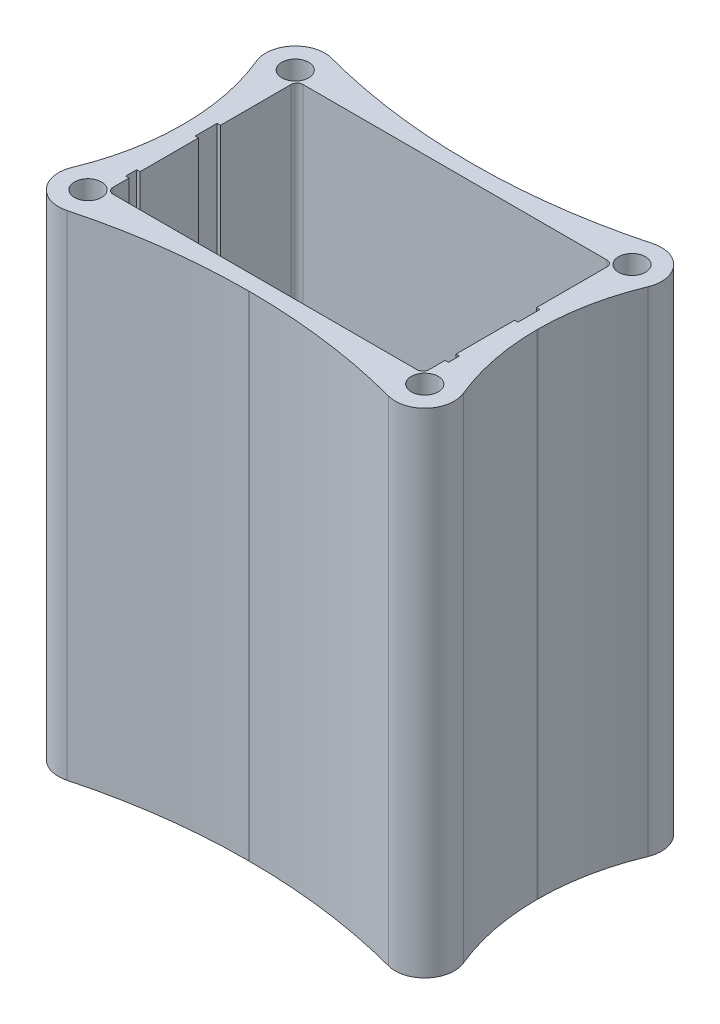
ISO-10303-21;
HEADER;
FILE_DESCRIPTION(('STEP AP214'),'2;1');
FILE_NAME('part.step','',(''),(''),'','','');
FILE_SCHEMA(('AUTOMOTIVE_DESIGN { 1 0 10303 214 1 1 1 1 }'));
ENDSEC;
DATA;
#1=APPLICATION_CONTEXT('core data for automotive mechanical design processes');
#2=APPLICATION_PROTOCOL_DEFINITION('international standard','automotive_design',2000,#1);
#3=PRODUCT_CONTEXT('',#1,'mechanical');
#4=PRODUCT('Part','Part','',(#3));
#5=PRODUCT_RELATED_PRODUCT_CATEGORY('part','',(#4));
#6=PRODUCT_DEFINITION_FORMATION('','',#4);
#7=PRODUCT_DEFINITION_CONTEXT('part definition',#1,'design');
#8=PRODUCT_DEFINITION('design','',#6,#7);
#9=PRODUCT_DEFINITION_SHAPE('','',#8);
#10=(LENGTH_UNIT() NAMED_UNIT(*) SI_UNIT(.MILLI.,.METRE.));
#11=(NAMED_UNIT(*) PLANE_ANGLE_UNIT() SI_UNIT($,.RADIAN.));
#12=(NAMED_UNIT(*) SI_UNIT($,.STERADIAN.) SOLID_ANGLE_UNIT());
#13=UNCERTAINTY_MEASURE_WITH_UNIT(LENGTH_MEASURE(1.E-05),#10,'distance_accuracy_value','');
#14=(GEOMETRIC_REPRESENTATION_CONTEXT(3) GLOBAL_UNCERTAINTY_ASSIGNED_CONTEXT((#13)) GLOBAL_UNIT_ASSIGNED_CONTEXT((#10,
#11,#12)) REPRESENTATION_CONTEXT('',''));
#15=CARTESIAN_POINT('',(0.,0.,0.));
#16=DIRECTION('',(0.,0.,1.));
#17=DIRECTION('',(1.,0.,0.));
#18=AXIS2_PLACEMENT_3D('',#15,#16,#17);
#19=CARTESIAN_POINT('',(-28.0642053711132,-7.25,-33.1035381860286));
#20=DIRECTION('',(0.,-1.,0.));
#21=DIRECTION('',(0.,0.,-1.));
#22=AXIS2_PLACEMENT_3D('',#19,#20,#21);
#23=PLANE('',#22);
#24=DIRECTION('',(0.,0.,1.));
#25=VECTOR('',#24,1.);
#26=CARTESIAN_POINT('',(18.15,-7.25,-17.115));
#27=LINE('',#26,#25);
#28=CARTESIAN_POINT('',(18.15,-7.25,-17.115));
#29=VERTEX_POINT('',#28);
#30=CARTESIAN_POINT('',(18.15,-7.25,-4.58500000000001));
#31=VERTEX_POINT('',#30);
#32=EDGE_CURVE('E1268',#29,#31,#27,.T.);
#33=ORIENTED_EDGE('',*,*,#32,.F.);
#34=DIRECTION('',(1.,0.,0.));
#35=VECTOR('',#34,1.);
#36=CARTESIAN_POINT('',(4.57,-7.25,-17.115));
#37=LINE('',#36,#35);
#38=CARTESIAN_POINT('',(4.57,-7.25,-17.115));
#39=VERTEX_POINT('',#38);
#40=EDGE_CURVE('E1266',#39,#29,#37,.T.);
#41=ORIENTED_EDGE('',*,*,#40,.F.);
#42=DIRECTION('',(0.,0.,1.));
#43=VECTOR('',#42,1.);
#44=CARTESIAN_POINT('',(4.57,-7.25,-17.115));
#45=LINE('',#44,#43);
#46=CARTESIAN_POINT('',(4.57,-7.25,-4.58500000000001));
#47=VERTEX_POINT('',#46);
#48=EDGE_CURVE('E1274',#39,#47,#45,.T.);
#49=ORIENTED_EDGE('',*,*,#48,.T.);
#50=DIRECTION('',(1.,0.,0.));
#51=VECTOR('',#50,1.);
#52=CARTESIAN_POINT('',(4.57,-7.25,-4.58500000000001));
#53=LINE('',#52,#51);
#54=EDGE_CURVE('E1271',#47,#31,#53,.T.);
#55=ORIENTED_EDGE('',*,*,#54,.T.);
#56=EDGE_LOOP('',(#33,#41,#49,#55));
#57=FACE_BOUND('',#56,.T.);
#58=DIRECTION('',(0.,0.,1.));
#59=VECTOR('',#58,1.);
#60=CARTESIAN_POINT('',(-29.56,-7.25,-28.4164283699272));
#61=LINE('',#60,#59);
#62=CARTESIAN_POINT('',(-29.56,-7.25,-15.901636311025));
#63=VERTEX_POINT('',#62);
#64=CARTESIAN_POINT('',(-29.56,-7.25,-15.768363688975));
#65=VERTEX_POINT('',#64);
#66=EDGE_CURVE('E1323',#63,#65,#61,.T.);
#67=ORIENTED_EDGE('',*,*,#66,.F.);
#68=CARTESIAN_POINT('',(-69.56,-7.25,-15.901636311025));
#69=DIRECTION('',(0.,-1.,0.));
#70=DIRECTION('',(0.,0.,-1.));
#71=AXIS2_PLACEMENT_3D('',#68,#69,#70);
#72=CIRCLE('',#71,40.);
#73=CARTESIAN_POINT('',(-32.609158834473,-7.25,-31.2194474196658));
#74=VERTEX_POINT('',#73);
#75=EDGE_CURVE('E1360',#63,#74,#72,.F.);
#76=ORIENTED_EDGE('',*,*,#75,.T.);
#77=CARTESIAN_POINT('',(-28.0642053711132,-7.25,-33.1035381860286));
#78=DIRECTION('',(0.,-1.,0.));
#79=DIRECTION('',(0.,0.,-1.));
#80=AXIS2_PLACEMENT_3D('',#77,#78,#79);
#81=CIRCLE('',#80,4.92000000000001);
#82=CARTESIAN_POINT('',(-26.7897521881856,-7.25,-37.8556081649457));
#83=VERTEX_POINT('',#82);
#84=EDGE_CURVE('E1303',#74,#83,#81,.T.);
#85=ORIENTED_EDGE('',*,*,#84,.T.);
#86=CARTESIAN_POINT('',(-0.109126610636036,-7.25,-137.34));
#87=DIRECTION('',(0.,-1.,0.));
#88=DIRECTION('',(0.,0.,-1.));
#89=AXIS2_PLACEMENT_3D('',#86,#87,#88);
#90=CIRCLE('',#89,103.);
#91=CARTESIAN_POINT('',(-0.109126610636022,-7.25,-34.34));
#92=VERTEX_POINT('',#91);
#93=EDGE_CURVE('E12',#83,#92,#90,.F.);
#94=ORIENTED_EDGE('',*,*,#93,.T.);
#95=DIRECTION('',(-1.,0.,0.));
#96=VECTOR('',#95,1.);
#97=CARTESIAN_POINT('',(23.3021089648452,-7.25,-34.34));
#98=LINE('',#97,#96);
#99=CARTESIAN_POINT('',(0.109126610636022,-7.25,-34.34));
#100=VERTEX_POINT('',#99);
#101=EDGE_CURVE('E1305',#100,#92,#98,.T.);
#102=ORIENTED_EDGE('',*,*,#101,.F.);
#103=CARTESIAN_POINT('',(0.109126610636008,-7.25,-137.34));
#104=DIRECTION('',(0.,-1.,0.));
#105=DIRECTION('',(0.,0.,-1.));
#106=AXIS2_PLACEMENT_3D('',#103,#104,#105);
#107=CIRCLE('',#106,103.);
#108=CARTESIAN_POINT('',(26.7897521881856,-7.25,-37.8556081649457));
#109=VERTEX_POINT('',#108);
#110=EDGE_CURVE('E1391',#100,#109,#107,.F.);
#111=ORIENTED_EDGE('',*,*,#110,.T.);
#112=CARTESIAN_POINT('',(28.0642053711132,-7.25,-33.1035381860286));
#113=DIRECTION('',(0.,1.,0.));
#114=DIRECTION('',(0.,0.,1.));
#115=AXIS2_PLACEMENT_3D('',#112,#113,#114);
#116=CIRCLE('',#115,4.92000000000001);
#117=CARTESIAN_POINT('',(32.609158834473,-7.25,-31.2194474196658));
#118=VERTEX_POINT('',#117);
#119=EDGE_CURVE('E1308',#118,#109,#116,.T.);
#120=ORIENTED_EDGE('',*,*,#119,.F.);
#121=CARTESIAN_POINT('',(69.56,-7.25,-15.901636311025));
#122=DIRECTION('',(0.,-1.,0.));
#123=DIRECTION('',(0.,0.,-1.));
#124=AXIS2_PLACEMENT_3D('',#121,#122,#123);
#125=CIRCLE('',#124,40.);
#126=CARTESIAN_POINT('',(29.56,-7.25,-15.901636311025));
#127=VERTEX_POINT('',#126);
#128=EDGE_CURVE('E1352',#118,#127,#125,.F.);
#129=ORIENTED_EDGE('',*,*,#128,.T.);
#130=DIRECTION('',(0.,0.,1.));
#131=VECTOR('',#130,1.);
#132=CARTESIAN_POINT('',(29.56,-7.25,-28.4164283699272));
#133=LINE('',#132,#131);
#134=CARTESIAN_POINT('',(29.56,-7.25,-15.768363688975));
#135=VERTEX_POINT('',#134);
#136=EDGE_CURVE('E1311',#127,#135,#133,.T.);
#137=ORIENTED_EDGE('',*,*,#136,.T.);
#138=CARTESIAN_POINT('',(69.56,-7.25,-15.768363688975));
#139=DIRECTION('',(0.,-1.,0.));
#140=DIRECTION('',(0.,0.,-1.));
#141=AXIS2_PLACEMENT_3D('',#138,#139,#140);
#142=CIRCLE('',#141,40.);
#143=CARTESIAN_POINT('',(32.609158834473,-7.25,-0.450552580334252));
#144=VERTEX_POINT('',#143);
#145=EDGE_CURVE('E1348',#135,#144,#142,.F.);
#146=ORIENTED_EDGE('',*,*,#145,.T.);
#147=CARTESIAN_POINT('',(28.0642053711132,-7.25,1.43353818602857));
#148=DIRECTION('',(0.,-1.,0.));
#149=DIRECTION('',(0.,0.,-1.));
#150=AXIS2_PLACEMENT_3D('',#147,#148,#149);
#151=CIRCLE('',#150,4.92);
#152=CARTESIAN_POINT('',(26.7897521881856,-7.25,6.18560816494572));
#153=VERTEX_POINT('',#152);
#154=EDGE_CURVE('E1314',#144,#153,#151,.T.);
#155=ORIENTED_EDGE('',*,*,#154,.T.);
#156=CARTESIAN_POINT('',(0.109126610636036,-7.25,105.67));
#157=DIRECTION('',(0.,-1.,0.));
#158=DIRECTION('',(0.,0.,-1.));
#159=AXIS2_PLACEMENT_3D('',#156,#157,#158);
#160=CIRCLE('',#159,103.);
#161=CARTESIAN_POINT('',(0.109126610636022,-7.25,2.67));
#162=VERTEX_POINT('',#161);
#163=EDGE_CURVE('E1383',#153,#162,#160,.F.);
#164=ORIENTED_EDGE('',*,*,#163,.T.);
#165=DIRECTION('',(-1.,0.,0.));
#166=VECTOR('',#165,1.);
#167=CARTESIAN_POINT('',(23.3021089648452,-7.25,2.67));
#168=LINE('',#167,#166);
#169=CARTESIAN_POINT('',(-0.109126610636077,-7.25,2.67));
#170=VERTEX_POINT('',#169);
#171=EDGE_CURVE('E1317',#162,#170,#168,.T.);
#172=ORIENTED_EDGE('',*,*,#171,.T.);
#173=CARTESIAN_POINT('',(-0.109126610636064,-7.25,105.67));
#174=DIRECTION('',(0.,-1.,0.));
#175=DIRECTION('',(0.,0.,-1.));
#176=AXIS2_PLACEMENT_3D('',#173,#174,#175);
#177=CIRCLE('',#176,103.);
#178=CARTESIAN_POINT('',(-26.7897521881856,-7.25,6.18560816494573));
#179=VERTEX_POINT('',#178);
#180=EDGE_CURVE('E1387',#170,#179,#177,.F.);
#181=ORIENTED_EDGE('',*,*,#180,.T.);
#182=CARTESIAN_POINT('',(-28.0642053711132,-7.25,1.43353818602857));
#183=DIRECTION('',(0.,1.,0.));
#184=DIRECTION('',(0.,0.,1.));
#185=AXIS2_PLACEMENT_3D('',#182,#183,#184);
#186=CIRCLE('',#185,4.92);
#187=CARTESIAN_POINT('',(-32.609158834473,-7.25,-0.450552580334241));
#188=VERTEX_POINT('',#187);
#189=EDGE_CURVE('E1320',#188,#179,#186,.T.);
#190=ORIENTED_EDGE('',*,*,#189,.F.);
#191=CARTESIAN_POINT('',(-69.56,-7.25,-15.768363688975));
#192=DIRECTION('',(0.,-1.,0.));
#193=DIRECTION('',(0.,0.,-1.));
#194=AXIS2_PLACEMENT_3D('',#191,#192,#193);
#195=CIRCLE('',#194,40.);
#196=EDGE_CURVE('E1356',#188,#65,#195,.F.);
#197=ORIENTED_EDGE('',*,*,#196,.T.);
#198=EDGE_LOOP('',(#67,#76,#85,#94,#102,#111,#120,#129,#137,#146,#155,#164,#172,#181,#190,#197));
#199=FACE_BOUND('',#198,.T.);
#200=CARTESIAN_POINT('',(-28.0642053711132,-7.25,1.43353818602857));
#201=DIRECTION('',(0.,1.,0.));
#202=DIRECTION('',(0.,0.,1.));
#203=AXIS2_PLACEMENT_3D('',#200,#201,#202);
#204=CIRCLE('',#203,2.25);
#205=CARTESIAN_POINT('',(-28.0642053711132,-7.25,3.68353818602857));
#206=VERTEX_POINT('',#205);
#207=EDGE_CURVE('E1300',#206,#206,#204,.T.);
#208=ORIENTED_EDGE('',*,*,#207,.T.);
#209=EDGE_LOOP('',(#208));
#210=FACE_BOUND('',#209,.T.);
#211=CARTESIAN_POINT('',(-28.0642053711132,-7.25,-33.1035381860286));
#212=DIRECTION('',(0.,-1.,0.));
#213=DIRECTION('',(0.,0.,-1.));
#214=AXIS2_PLACEMENT_3D('',#211,#212,#213);
#215=CIRCLE('',#214,2.25);
#216=CARTESIAN_POINT('',(-28.0642053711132,-7.25,-30.8535381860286));
#217=VERTEX_POINT('',#216);
#218=EDGE_CURVE('E1297',#217,#217,#215,.T.);
#219=ORIENTED_EDGE('',*,*,#218,.F.);
#220=EDGE_LOOP('',(#219));
#221=FACE_BOUND('',#220,.T.);
#222=CARTESIAN_POINT('',(28.0642053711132,-7.25,-33.1035381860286));
#223=DIRECTION('',(0.,1.,0.));
#224=DIRECTION('',(0.,0.,1.));
#225=AXIS2_PLACEMENT_3D('',#222,#223,#224);
#226=CIRCLE('',#225,2.25);
#227=CARTESIAN_POINT('',(28.0642053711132,-7.25,-30.8535381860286));
#228=VERTEX_POINT('',#227);
#229=EDGE_CURVE('E1262',#228,#228,#226,.T.);
#230=ORIENTED_EDGE('',*,*,#229,.T.);
#231=EDGE_LOOP('',(#230));
#232=FACE_BOUND('',#231,.T.);
#233=CARTESIAN_POINT('',(28.0642053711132,-7.25,1.43353818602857));
#234=DIRECTION('',(0.,-1.,0.));
#235=DIRECTION('',(0.,0.,-1.));
#236=AXIS2_PLACEMENT_3D('',#233,#234,#235);
#237=CIRCLE('',#236,2.25);
#238=CARTESIAN_POINT('',(28.0642053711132,-7.25,3.68353818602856));
#239=VERTEX_POINT('',#238);
#240=EDGE_CURVE('E1253',#239,#239,#237,.T.);
#241=ORIENTED_EDGE('',*,*,#240,.F.);
#242=EDGE_LOOP('',(#241));
#243=FACE_BOUND('',#242,.T.);
#244=ADVANCED_FACE('F695',(#57,#199,#210,#221,#232,#243),#23,.T.);
#245=CARTESIAN_POINT('',(-28.0642053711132,0.,-33.1035381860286));
#246=DIRECTION('',(0.,-1.,0.));
#247=DIRECTION('',(0.,0.,-1.));
#248=AXIS2_PLACEMENT_3D('',#245,#246,#247);
#249=PLANE('',#248);
#250=DIRECTION('',(0.,0.,-1.));
#251=VECTOR('',#250,1.);
#252=CARTESIAN_POINT('',(26.33,0.,-18.915));
#253=LINE('',#252,#251);
#254=CARTESIAN_POINT('',(26.33,0.,-18.915));
#255=VERTEX_POINT('',#254);
#256=CARTESIAN_POINT('',(26.33,0.,-30.67));
#257=VERTEX_POINT('',#256);
#258=EDGE_CURVE('E1012',#255,#257,#253,.T.);
#259=ORIENTED_EDGE('',*,*,#258,.T.);
#260=CARTESIAN_POINT('',(25.33,0.,-30.67));
#261=DIRECTION('',(0.,1.,0.));
#262=DIRECTION('',(0.,0.,1.));
#263=AXIS2_PLACEMENT_3D('',#260,#261,#262);
#264=CIRCLE('',#263,0.999999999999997);
#265=CARTESIAN_POINT('',(25.33,0.,-31.67));
#266=VERTEX_POINT('',#265);
#267=EDGE_CURVE('E1081',#257,#266,#264,.T.);
#268=ORIENTED_EDGE('',*,*,#267,.T.);
#269=DIRECTION('',(-1.,0.,0.));
#270=VECTOR('',#269,1.);
#271=CARTESIAN_POINT('',(25.33,0.,-31.67));
#272=LINE('',#271,#270);
#273=CARTESIAN_POINT('',(-25.33,0.,-31.67));
#274=VERTEX_POINT('',#273);
#275=EDGE_CURVE('E1018',#266,#274,#272,.T.);
#276=ORIENTED_EDGE('',*,*,#275,.T.);
#277=CARTESIAN_POINT('',(-25.33,0.,-30.67));
#278=DIRECTION('',(0.,-1.,0.));
#279=DIRECTION('',(0.,0.,-1.));
#280=AXIS2_PLACEMENT_3D('',#277,#278,#279);
#281=CIRCLE('',#280,0.999999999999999);
#282=CARTESIAN_POINT('',(-26.33,0.,-30.67));
#283=VERTEX_POINT('',#282);
#284=EDGE_CURVE('E1084',#283,#274,#281,.T.);
#285=ORIENTED_EDGE('',*,*,#284,.F.);
#286=DIRECTION('',(0.,0.,-1.));
#287=VECTOR('',#286,1.);
#288=CARTESIAN_POINT('',(-26.33,0.,-18.915));
#289=LINE('',#288,#287);
#290=CARTESIAN_POINT('',(-26.33,0.,-18.915));
#291=VERTEX_POINT('',#290);
#292=EDGE_CURVE('E1087',#291,#283,#289,.T.);
#293=ORIENTED_EDGE('',*,*,#292,.F.);
#294=DIRECTION('',(-1.,0.,0.));
#295=VECTOR('',#294,1.);
#296=CARTESIAN_POINT('',(-26.33,0.,-18.915));
#297=LINE('',#296,#295);
#298=CARTESIAN_POINT('',(-26.89,0.,-18.915));
#299=VERTEX_POINT('',#298);
#300=EDGE_CURVE('E1090',#291,#299,#297,.T.);
#301=ORIENTED_EDGE('',*,*,#300,.T.);
#302=DIRECTION('',(0.,0.,1.));
#303=VECTOR('',#302,1.);
#304=CARTESIAN_POINT('',(-26.89,0.,-17.085));
#305=LINE('',#304,#303);
#306=CARTESIAN_POINT('',(-26.89,0.,-15.255));
#307=VERTEX_POINT('',#306);
#308=EDGE_CURVE('E1093',#299,#307,#305,.T.);
#309=ORIENTED_EDGE('',*,*,#308,.T.);
#310=DIRECTION('',(1.,0.,0.));
#311=VECTOR('',#310,1.);
#312=CARTESIAN_POINT('',(-26.89,0.,-15.255));
#313=LINE('',#312,#311);
#314=CARTESIAN_POINT('',(-26.33,0.,-15.255));
#315=VERTEX_POINT('',#314);
#316=EDGE_CURVE('E1096',#307,#315,#313,.T.);
#317=ORIENTED_EDGE('',*,*,#316,.T.);
#318=DIRECTION('',(0.,0.,-1.));
#319=VECTOR('',#318,1.);
#320=CARTESIAN_POINT('',(-26.33,0.,-5.50000000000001));
#321=LINE('',#320,#319);
#322=CARTESIAN_POINT('',(-26.33,0.,-5.50000000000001));
#323=VERTEX_POINT('',#322);
#324=EDGE_CURVE('E1099',#323,#315,#321,.T.);
#325=ORIENTED_EDGE('',*,*,#324,.F.);
#326=DIRECTION('',(1.,0.,0.));
#327=VECTOR('',#326,1.);
#328=CARTESIAN_POINT('',(-26.89,0.,-5.49999999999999));
#329=LINE('',#328,#327);
#330=CARTESIAN_POINT('',(-26.89,0.,-5.49999999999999));
#331=VERTEX_POINT('',#330);
#332=EDGE_CURVE('E1102',#331,#323,#329,.T.);
#333=ORIENTED_EDGE('',*,*,#332,.F.);
#334=DIRECTION('',(0.,0.,-1.));
#335=VECTOR('',#334,1.);
#336=CARTESIAN_POINT('',(-26.89,0.,-3.67000000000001));
#337=LINE('',#336,#335);
#338=CARTESIAN_POINT('',(-26.89,0.,-3.67000000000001));
#339=VERTEX_POINT('',#338);
#340=EDGE_CURVE('E1105',#339,#331,#337,.T.);
#341=ORIENTED_EDGE('',*,*,#340,.F.);
#342=DIRECTION('',(-1.,0.,0.));
#343=VECTOR('',#342,1.);
#344=CARTESIAN_POINT('',(-26.33,0.,-3.67));
#345=LINE('',#344,#343);
#346=CARTESIAN_POINT('',(-26.33,0.,-3.67));
#347=VERTEX_POINT('',#346);
#348=EDGE_CURVE('E1108',#347,#339,#345,.T.);
#349=ORIENTED_EDGE('',*,*,#348,.F.);
#350=DIRECTION('',(0.,0.,-1.));
#351=VECTOR('',#350,1.);
#352=CARTESIAN_POINT('',(-26.33,0.,-1.));
#353=LINE('',#352,#351);
#354=CARTESIAN_POINT('',(-26.33,0.,-1.));
#355=VERTEX_POINT('',#354);
#356=EDGE_CURVE('E1111',#355,#347,#353,.T.);
#357=ORIENTED_EDGE('',*,*,#356,.F.);
#358=CARTESIAN_POINT('',(-25.33,0.,-1.));
#359=DIRECTION('',(0.,-1.,0.));
#360=DIRECTION('',(0.,0.,-1.));
#361=AXIS2_PLACEMENT_3D('',#358,#359,#360);
#362=CIRCLE('',#361,0.999999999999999);
#363=CARTESIAN_POINT('',(-25.33,0.,0.));
#364=VERTEX_POINT('',#363);
#365=EDGE_CURVE('E1114',#364,#355,#362,.T.);
#366=ORIENTED_EDGE('',*,*,#365,.F.);
#367=DIRECTION('',(1.,0.,0.));
#368=VECTOR('',#367,1.);
#369=CARTESIAN_POINT('',(-25.33,0.,0.));
#370=LINE('',#369,#368);
#371=CARTESIAN_POINT('',(25.33,0.,0.));
#372=VERTEX_POINT('',#371);
#373=EDGE_CURVE('E1117',#364,#372,#370,.T.);
#374=ORIENTED_EDGE('',*,*,#373,.T.);
#375=CARTESIAN_POINT('',(25.33,0.,-1.00000000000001));
#376=DIRECTION('',(0.,1.,0.));
#377=DIRECTION('',(0.,0.,1.));
#378=AXIS2_PLACEMENT_3D('',#375,#376,#377);
#379=CIRCLE('',#378,0.999999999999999);
#380=CARTESIAN_POINT('',(26.33,0.,-1.00000000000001));
#381=VERTEX_POINT('',#380);
#382=EDGE_CURVE('E1120',#372,#381,#379,.T.);
#383=ORIENTED_EDGE('',*,*,#382,.T.);
#384=DIRECTION('',(0.,0.,-1.));
#385=VECTOR('',#384,1.);
#386=CARTESIAN_POINT('',(26.33,0.,-1.00000000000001));
#387=LINE('',#386,#385);
#388=CARTESIAN_POINT('',(26.33,0.,-3.67));
#389=VERTEX_POINT('',#388);
#390=EDGE_CURVE('E1123',#381,#389,#387,.T.);
#391=ORIENTED_EDGE('',*,*,#390,.T.);
#392=DIRECTION('',(1.,0.,0.));
#393=VECTOR('',#392,1.);
#394=CARTESIAN_POINT('',(26.33,0.,-3.67));
#395=LINE('',#394,#393);
#396=CARTESIAN_POINT('',(26.89,0.,-3.67000000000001));
#397=VERTEX_POINT('',#396);
#398=EDGE_CURVE('E1126',#389,#397,#395,.T.);
#399=ORIENTED_EDGE('',*,*,#398,.T.);
#400=DIRECTION('',(0.,0.,-1.));
#401=VECTOR('',#400,1.);
#402=CARTESIAN_POINT('',(26.89,0.,-3.67000000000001));
#403=LINE('',#402,#401);
#404=CARTESIAN_POINT('',(26.89,0.,-5.50000000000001));
#405=VERTEX_POINT('',#404);
#406=EDGE_CURVE('E1129',#397,#405,#403,.T.);
#407=ORIENTED_EDGE('',*,*,#406,.T.);
#408=DIRECTION('',(-1.,0.,0.));
#409=VECTOR('',#408,1.);
#410=CARTESIAN_POINT('',(26.89,0.,-5.50000000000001));
#411=LINE('',#410,#409);
#412=CARTESIAN_POINT('',(26.33,0.,-5.50000000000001));
#413=VERTEX_POINT('',#412);
#414=EDGE_CURVE('E1132',#405,#413,#411,.T.);
#415=ORIENTED_EDGE('',*,*,#414,.T.);
#416=DIRECTION('',(0.,0.,-1.));
#417=VECTOR('',#416,1.);
#418=CARTESIAN_POINT('',(26.33,0.,-5.50000000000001));
#419=LINE('',#418,#417);
#420=CARTESIAN_POINT('',(26.33,0.,-15.255));
#421=VERTEX_POINT('',#420);
#422=EDGE_CURVE('E1135',#413,#421,#419,.T.);
#423=ORIENTED_EDGE('',*,*,#422,.T.);
#424=DIRECTION('',(-1.,0.,0.));
#425=VECTOR('',#424,1.);
#426=CARTESIAN_POINT('',(26.89,0.,-15.255));
#427=LINE('',#426,#425);
#428=CARTESIAN_POINT('',(26.89,0.,-15.255));
#429=VERTEX_POINT('',#428);
#430=EDGE_CURVE('E1138',#429,#421,#427,.T.);
#431=ORIENTED_EDGE('',*,*,#430,.F.);
#432=DIRECTION('',(0.,0.,1.));
#433=VECTOR('',#432,1.);
#434=CARTESIAN_POINT('',(26.89,0.,-18.915));
#435=LINE('',#434,#433);
#436=CARTESIAN_POINT('',(26.89,0.,-18.915));
#437=VERTEX_POINT('',#436);
#438=EDGE_CURVE('E1141',#437,#429,#435,.T.);
#439=ORIENTED_EDGE('',*,*,#438,.F.);
#440=DIRECTION('',(1.,0.,0.));
#441=VECTOR('',#440,1.);
#442=CARTESIAN_POINT('',(26.33,0.,-18.915));
#443=LINE('',#442,#441);
#444=EDGE_CURVE('E1144',#255,#437,#443,.T.);
#445=ORIENTED_EDGE('',*,*,#444,.F.);
#446=EDGE_LOOP('',(#259,#268,#276,#285,#293,#301,#309,#317,#325,#333,#341,#349,#357,#366,#374,
#383,#391,#399,#407,#415,#423,#431,#439,#445));
#447=FACE_BOUND('',#446,.T.);
#448=DIRECTION('',(1.,0.,0.));
#449=VECTOR('',#448,1.);
#450=CARTESIAN_POINT('',(-22.89,0.,-4.585));
#451=LINE('',#450,#449);
#452=CARTESIAN_POINT('',(-22.89,0.,-4.58500000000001));
#453=VERTEX_POINT('',#452);
#454=CARTESIAN_POINT('',(-12.89,0.,-4.585));
#455=VERTEX_POINT('',#454);
#456=EDGE_CURVE('E1243',#453,#455,#451,.T.);
#457=ORIENTED_EDGE('',*,*,#456,.F.);
#458=DIRECTION('',(0.,0.,1.));
#459=VECTOR('',#458,1.);
#460=CARTESIAN_POINT('',(-22.89,0.,-4.585));
#461=LINE('',#460,#459);
#462=CARTESIAN_POINT('',(-22.89,0.,-17.115));
#463=VERTEX_POINT('',#462);
#464=EDGE_CURVE('E1227',#463,#453,#461,.T.);
#465=ORIENTED_EDGE('',*,*,#464,.F.);
#466=DIRECTION('',(-1.,0.,0.));
#467=VECTOR('',#466,1.);
#468=CARTESIAN_POINT('',(-22.89,0.,-17.115));
#469=LINE('',#468,#467);
#470=CARTESIAN_POINT('',(-12.89,0.,-17.115));
#471=VERTEX_POINT('',#470);
#472=EDGE_CURVE('E1232',#471,#463,#469,.T.);
#473=ORIENTED_EDGE('',*,*,#472,.F.);
#474=DIRECTION('',(0.,0.,-1.));
#475=VECTOR('',#474,1.);
#476=CARTESIAN_POINT('',(-12.89,0.,-4.585));
#477=LINE('',#476,#475);
#478=EDGE_CURVE('E1246',#455,#471,#477,.T.);
#479=ORIENTED_EDGE('',*,*,#478,.F.);
#480=EDGE_LOOP('',(#457,#465,#473,#479));
#481=FACE_BOUND('',#480,.T.);
#482=DIRECTION('',(1.,0.,0.));
#483=VECTOR('',#482,1.);
#484=CARTESIAN_POINT('',(4.57,0.,-17.115));
#485=LINE('',#484,#483);
#486=CARTESIAN_POINT('',(4.57,0.,-17.115));
#487=VERTEX_POINT('',#486);
#488=CARTESIAN_POINT('',(18.15,0.,-17.115));
#489=VERTEX_POINT('',#488);
#490=EDGE_CURVE('E1265',#487,#489,#485,.T.);
#491=ORIENTED_EDGE('',*,*,#490,.T.);
#492=DIRECTION('',(0.,0.,1.));
#493=VECTOR('',#492,1.);
#494=CARTESIAN_POINT('',(18.15,0.,-17.115));
#495=LINE('',#494,#493);
#496=CARTESIAN_POINT('',(18.15,0.,-4.58500000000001));
#497=VERTEX_POINT('',#496);
#498=EDGE_CURVE('E1280',#489,#497,#495,.T.);
#499=ORIENTED_EDGE('',*,*,#498,.T.);
#500=DIRECTION('',(1.,0.,0.));
#501=VECTOR('',#500,1.);
#502=CARTESIAN_POINT('',(4.57,0.,-4.58500000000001));
#503=LINE('',#502,#501);
#504=CARTESIAN_POINT('',(4.57,0.,-4.58500000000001));
#505=VERTEX_POINT('',#504);
#506=EDGE_CURVE('E1283',#505,#497,#503,.T.);
#507=ORIENTED_EDGE('',*,*,#506,.F.);
#508=DIRECTION('',(0.,0.,1.));
#509=VECTOR('',#508,1.);
#510=CARTESIAN_POINT('',(4.57,0.,-17.115));
#511=LINE('',#510,#509);
#512=EDGE_CURVE('E1269',#487,#505,#511,.T.);
#513=ORIENTED_EDGE('',*,*,#512,.F.);
#514=EDGE_LOOP('',(#491,#499,#507,#513));
#515=FACE_BOUND('',#514,.T.);
#516=ADVANCED_FACE('F1472',(#447,#481,#515),#249,.F.);
#517=CARTESIAN_POINT('',(-28.0642053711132,-7.25,-33.1035381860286));
#518=DIRECTION('',(0.,1.,0.));
#519=DIRECTION('',(0.,0.,1.));
#520=AXIS2_PLACEMENT_3D('',#517,#518,#519);
#521=CYLINDRICAL_SURFACE('',#520,4.92000000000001);
#522=CARTESIAN_POINT('',(-28.0642053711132,75.,-33.1035381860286));
#523=DIRECTION('',(0.,-1.,0.));
#524=DIRECTION('',(0.,0.,-1.));
#525=AXIS2_PLACEMENT_3D('',#522,#523,#524);
#526=CIRCLE('',#525,4.92000000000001);
#527=CARTESIAN_POINT('',(-32.609158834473,75.,-31.2194474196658));
#528=VERTEX_POINT('',#527);
#529=CARTESIAN_POINT('',(-26.7897521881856,75.,-37.8556081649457));
#530=VERTEX_POINT('',#529);
#531=EDGE_CURVE('E1220',#528,#530,#526,.T.);
#532=ORIENTED_EDGE('',*,*,#531,.T.);
#533=DIRECTION('',(0.,1.,0.));
#534=VECTOR('',#533,1.);
#535=CARTESIAN_POINT('',(-26.7897521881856,-7.25,-37.8556081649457));
#536=LINE('',#535,#534);
#537=EDGE_CURVE('E716',#530,#83,#536,.F.);
#538=ORIENTED_EDGE('',*,*,#537,.T.);
#539=ORIENTED_EDGE('',*,*,#84,.F.);
#540=DIRECTION('',(0.,1.,0.));
#541=VECTOR('',#540,1.);
#542=CARTESIAN_POINT('',(-32.609158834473,-7.25,-31.2194474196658));
#543=LINE('',#542,#541);
#544=EDGE_CURVE('E1343',#74,#528,#543,.T.);
#545=ORIENTED_EDGE('',*,*,#544,.T.);
#546=EDGE_LOOP('',(#532,#538,#539,#545));
#547=FACE_BOUND('',#546,.T.);
#548=ADVANCED_FACE('F1417',(#547),#521,.T.);
#549=CARTESIAN_POINT('',(23.3021089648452,-7.25,-34.34));
#550=DIRECTION('',(0.,0.,-1.));
#551=DIRECTION('',(-1.,0.,0.));
#552=AXIS2_PLACEMENT_3D('',#549,#550,#551);
#553=PLANE('',#552);
#554=DIRECTION('',(-1.,0.,0.));
#555=VECTOR('',#554,1.);
#556=CARTESIAN_POINT('',(23.3021089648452,75.,-34.34));
#557=LINE('',#556,#555);
#558=CARTESIAN_POINT('',(0.109126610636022,75.,-34.34));
#559=VERTEX_POINT('',#558);
#560=CARTESIAN_POINT('',(-0.109126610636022,75.,-34.34));
#561=VERTEX_POINT('',#560);
#562=EDGE_CURVE('E1222',#559,#561,#557,.T.);
#563=ORIENTED_EDGE('',*,*,#562,.F.);
#564=DIRECTION('',(0.,-1.,0.));
#565=VECTOR('',#564,1.);
#566=CARTESIAN_POINT('',(0.109126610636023,-7.25,-34.34));
#567=LINE('',#566,#565);
#568=EDGE_CURVE('E1378',#559,#100,#567,.T.);
#569=ORIENTED_EDGE('',*,*,#568,.T.);
#570=ORIENTED_EDGE('',*,*,#101,.T.);
#571=DIRECTION('',(0.,1.,0.));
#572=VECTOR('',#571,1.);
#573=CARTESIAN_POINT('',(-0.109126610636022,-7.25,-34.34));
#574=LINE('',#573,#572);
#575=EDGE_CURVE('E1375',#92,#561,#574,.T.);
#576=ORIENTED_EDGE('',*,*,#575,.T.);
#577=EDGE_LOOP('',(#563,#569,#570,#576));
#578=FACE_BOUND('',#577,.T.);
#579=ADVANCED_FACE('F1411',(#578),#553,.T.);
#580=CARTESIAN_POINT('',(28.0642053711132,-7.25,-33.1035381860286));
#581=DIRECTION('',(0.,1.,0.));
#582=DIRECTION('',(0.,0.,1.));
#583=AXIS2_PLACEMENT_3D('',#580,#581,#582);
#584=CYLINDRICAL_SURFACE('',#583,4.92000000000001);
#585=ORIENTED_EDGE('',*,*,#119,.T.);
#586=DIRECTION('',(0.,1.,0.));
#587=VECTOR('',#586,1.);
#588=CARTESIAN_POINT('',(26.7897521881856,-7.25,-37.8556081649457));
#589=LINE('',#588,#587);
#590=CARTESIAN_POINT('',(26.7897521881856,75.,-37.8556081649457));
#591=VERTEX_POINT('',#590);
#592=EDGE_CURVE('E1372',#109,#591,#589,.T.);
#593=ORIENTED_EDGE('',*,*,#592,.T.);
#594=CARTESIAN_POINT('',(28.0642053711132,75.,-33.1035381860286));
#595=DIRECTION('',(0.,1.,0.));
#596=DIRECTION('',(0.,0.,1.));
#597=AXIS2_PLACEMENT_3D('',#594,#595,#596);
#598=CIRCLE('',#597,4.92000000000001);
#599=CARTESIAN_POINT('',(32.609158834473,75.,-31.2194474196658));
#600=VERTEX_POINT('',#599);
#601=EDGE_CURVE('E1224',#600,#591,#598,.T.);
#602=ORIENTED_EDGE('',*,*,#601,.F.);
#603=DIRECTION('',(0.,1.,0.));
#604=VECTOR('',#603,1.);
#605=CARTESIAN_POINT('',(32.609158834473,-7.25,-31.2194474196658));
#606=LINE('',#605,#604);
#607=EDGE_CURVE('E1334',#600,#118,#606,.F.);
#608=ORIENTED_EDGE('',*,*,#607,.T.);
#609=EDGE_LOOP('',(#585,#593,#602,#608));
#610=FACE_BOUND('',#609,.T.);
#611=ADVANCED_FACE('F1403',(#610),#584,.T.);
#612=CARTESIAN_POINT('',(29.56,-7.25,-28.4164283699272));
#613=DIRECTION('',(-1.,0.,0.));
#614=DIRECTION('',(0.,0.,1.));
#615=AXIS2_PLACEMENT_3D('',#612,#613,#614);
#616=PLANE('',#615);
#617=DIRECTION('',(0.,0.,1.));
#618=VECTOR('',#617,1.);
#619=CARTESIAN_POINT('',(29.56,75.,-28.4164283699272));
#620=LINE('',#619,#618);
#621=CARTESIAN_POINT('',(29.56,75.,-15.901636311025));
#622=VERTEX_POINT('',#621);
#623=CARTESIAN_POINT('',(29.56,75.,-15.768363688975));
#624=VERTEX_POINT('',#623);
#625=EDGE_CURVE('E1205',#622,#624,#620,.T.);
#626=ORIENTED_EDGE('',*,*,#625,.T.);
#627=DIRECTION('',(0.,-1.,0.));
#628=VECTOR('',#627,1.);
#629=CARTESIAN_POINT('',(29.56,-7.25,-15.768363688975));
#630=LINE('',#629,#628);
#631=EDGE_CURVE('E1332',#624,#135,#630,.T.);
#632=ORIENTED_EDGE('',*,*,#631,.T.);
#633=ORIENTED_EDGE('',*,*,#136,.F.);
#634=DIRECTION('',(0.,1.,0.));
#635=VECTOR('',#634,1.);
#636=CARTESIAN_POINT('',(29.56,-7.25,-15.901636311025));
#637=LINE('',#636,#635);
#638=EDGE_CURVE('E1329',#127,#622,#637,.T.);
#639=ORIENTED_EDGE('',*,*,#638,.T.);
#640=EDGE_LOOP('',(#626,#632,#633,#639));
#641=FACE_BOUND('',#640,.T.);
#642=ADVANCED_FACE('F1457',(#641),#616,.F.);
#643=CARTESIAN_POINT('',(28.0642053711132,-7.25,1.43353818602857));
#644=DIRECTION('',(0.,1.,0.));
#645=DIRECTION('',(0.,0.,1.));
#646=AXIS2_PLACEMENT_3D('',#643,#644,#645);
#647=CYLINDRICAL_SURFACE('',#646,4.92);
#648=CARTESIAN_POINT('',(28.0642053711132,75.,1.43353818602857));
#649=DIRECTION('',(0.,-1.,0.));
#650=DIRECTION('',(0.,0.,-1.));
#651=AXIS2_PLACEMENT_3D('',#648,#649,#650);
#652=CIRCLE('',#651,4.92);
#653=CARTESIAN_POINT('',(32.609158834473,75.,-0.450552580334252));
#654=VERTEX_POINT('',#653);
#655=CARTESIAN_POINT('',(26.7897521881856,75.,6.18560816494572));
#656=VERTEX_POINT('',#655);
#657=EDGE_CURVE('E1208',#654,#656,#652,.T.);
#658=ORIENTED_EDGE('',*,*,#657,.T.);
#659=DIRECTION('',(0.,1.,0.));
#660=VECTOR('',#659,1.);
#661=CARTESIAN_POINT('',(26.7897521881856,-7.25,6.18560816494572));
#662=LINE('',#661,#660);
#663=EDGE_CURVE('E1367',#656,#153,#662,.F.);
#664=ORIENTED_EDGE('',*,*,#663,.T.);
#665=ORIENTED_EDGE('',*,*,#154,.F.);
#666=DIRECTION('',(0.,1.,0.));
#667=VECTOR('',#666,1.);
#668=CARTESIAN_POINT('',(32.609158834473,-7.25,-0.450552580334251));
#669=LINE('',#668,#667);
#670=EDGE_CURVE('E1326',#144,#654,#669,.T.);
#671=ORIENTED_EDGE('',*,*,#670,.T.);
#672=EDGE_LOOP('',(#658,#664,#665,#671));
#673=FACE_BOUND('',#672,.T.);
#674=ADVANCED_FACE('F1449',(#673),#647,.T.);
#675=CARTESIAN_POINT('',(23.3021089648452,-7.25,2.67));
#676=DIRECTION('',(0.,0.,-1.));
#677=DIRECTION('',(-1.,0.,0.));
#678=AXIS2_PLACEMENT_3D('',#675,#676,#677);
#679=PLANE('',#678);
#680=ORIENTED_EDGE('',*,*,#171,.F.);
#681=DIRECTION('',(0.,-1.,0.));
#682=VECTOR('',#681,1.);
#683=CARTESIAN_POINT('',(0.109126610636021,75.,2.67));
#684=LINE('',#683,#682);
#685=CARTESIAN_POINT('',(0.109126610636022,75.,2.67));
#686=VERTEX_POINT('',#685);
#687=EDGE_CURVE('E1364',#162,#686,#684,.F.);
#688=ORIENTED_EDGE('',*,*,#687,.T.);
#689=DIRECTION('',(-1.,0.,0.));
#690=VECTOR('',#689,1.);
#691=CARTESIAN_POINT('',(23.3021089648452,75.,2.67));
#692=LINE('',#691,#690);
#693=CARTESIAN_POINT('',(-0.109126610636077,75.,2.67));
#694=VERTEX_POINT('',#693);
#695=EDGE_CURVE('E1211',#686,#694,#692,.T.);
#696=ORIENTED_EDGE('',*,*,#695,.T.);
#697=DIRECTION('',(0.,1.,0.));
#698=VECTOR('',#697,1.);
#699=CARTESIAN_POINT('',(-0.109126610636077,-7.25,2.67));
#700=LINE('',#699,#698);
#701=EDGE_CURVE('E1362',#694,#170,#700,.F.);
#702=ORIENTED_EDGE('',*,*,#701,.T.);
#703=EDGE_LOOP('',(#680,#688,#696,#702));
#704=FACE_BOUND('',#703,.T.);
#705=ADVANCED_FACE('F1441',(#704),#679,.F.);
#706=CARTESIAN_POINT('',(-28.0642053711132,-7.25,1.43353818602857));
#707=DIRECTION('',(0.,1.,0.));
#708=DIRECTION('',(0.,0.,1.));
#709=AXIS2_PLACEMENT_3D('',#706,#707,#708);
#710=CYLINDRICAL_SURFACE('',#709,4.92);
#711=ORIENTED_EDGE('',*,*,#189,.T.);
#712=DIRECTION('',(0.,1.,0.));
#713=VECTOR('',#712,1.);
#714=CARTESIAN_POINT('',(-26.7897521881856,-7.25,6.18560816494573));
#715=LINE('',#714,#713);
#716=CARTESIAN_POINT('',(-26.7897521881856,75.,6.18560816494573));
#717=VERTEX_POINT('',#716);
#718=EDGE_CURVE('E1369',#179,#717,#715,.T.);
#719=ORIENTED_EDGE('',*,*,#718,.T.);
#720=CARTESIAN_POINT('',(-28.0642053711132,75.,1.43353818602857));
#721=DIRECTION('',(0.,1.,0.));
#722=DIRECTION('',(0.,0.,1.));
#723=AXIS2_PLACEMENT_3D('',#720,#721,#722);
#724=CIRCLE('',#723,4.92);
#725=CARTESIAN_POINT('',(-32.609158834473,75.,-0.450552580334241));
#726=VERTEX_POINT('',#725);
#727=EDGE_CURVE('E1214',#726,#717,#724,.T.);
#728=ORIENTED_EDGE('',*,*,#727,.F.);
#729=DIRECTION('',(0.,1.,0.));
#730=VECTOR('',#729,1.);
#731=CARTESIAN_POINT('',(-32.609158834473,-7.25,-0.450552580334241));
#732=LINE('',#731,#730);
#733=EDGE_CURVE('E1341',#726,#188,#732,.F.);
#734=ORIENTED_EDGE('',*,*,#733,.T.);
#735=EDGE_LOOP('',(#711,#719,#728,#734));
#736=FACE_BOUND('',#735,.T.);
#737=ADVANCED_FACE('F1431',(#736),#710,.T.);
#738=CARTESIAN_POINT('',(-29.56,-7.25,-28.4164283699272));
#739=DIRECTION('',(-1.,0.,0.));
#740=DIRECTION('',(0.,0.,1.));
#741=AXIS2_PLACEMENT_3D('',#738,#739,#740);
#742=PLANE('',#741);
#743=ORIENTED_EDGE('',*,*,#66,.T.);
#744=DIRECTION('',(0.,-1.,0.));
#745=VECTOR('',#744,1.);
#746=CARTESIAN_POINT('',(-29.56,75.,-15.768363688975));
#747=LINE('',#746,#745);
#748=CARTESIAN_POINT('',(-29.56,75.,-15.768363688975));
#749=VERTEX_POINT('',#748);
#750=EDGE_CURVE('E1338',#65,#749,#747,.F.);
#751=ORIENTED_EDGE('',*,*,#750,.T.);
#752=DIRECTION('',(0.,0.,1.));
#753=VECTOR('',#752,1.);
#754=CARTESIAN_POINT('',(-29.56,75.,-28.4164283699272));
#755=LINE('',#754,#753);
#756=CARTESIAN_POINT('',(-29.56,75.,-15.901636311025));
#757=VERTEX_POINT('',#756);
#758=EDGE_CURVE('E1217',#757,#749,#755,.T.);
#759=ORIENTED_EDGE('',*,*,#758,.F.);
#760=DIRECTION('',(0.,1.,0.));
#761=VECTOR('',#760,1.);
#762=CARTESIAN_POINT('',(-29.56,-7.25,-15.901636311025));
#763=LINE('',#762,#761);
#764=EDGE_CURVE('E1336',#757,#63,#763,.F.);
#765=ORIENTED_EDGE('',*,*,#764,.T.);
#766=EDGE_LOOP('',(#743,#751,#759,#765));
#767=FACE_BOUND('',#766,.T.);
#768=ADVANCED_FACE('F1423',(#767),#742,.T.);
#769=CARTESIAN_POINT('',(-28.0642053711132,-7.25,1.43353818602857));
#770=DIRECTION('',(0.,1.,0.));
#771=DIRECTION('',(0.,0.,1.));
#772=AXIS2_PLACEMENT_3D('',#769,#770,#771);
#773=CYLINDRICAL_SURFACE('',#772,2.25);
#774=CARTESIAN_POINT('',(-28.0642053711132,75.,1.43353818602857));
#775=DIRECTION('',(0.,1.,0.));
#776=DIRECTION('',(0.,0.,1.));
#777=AXIS2_PLACEMENT_3D('',#774,#775,#776);
#778=CIRCLE('',#777,2.25);
#779=CARTESIAN_POINT('',(-28.0642053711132,75.,3.68353818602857));
#780=VERTEX_POINT('',#779);
#781=EDGE_CURVE('E1199',#780,#780,#778,.T.);
#782=CARTESIAN_POINT('',(-28.0642053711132,-7.25,3.68353818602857));
#783=CARTESIAN_POINT('',(-28.0642053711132,-6.39322916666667,3.68353818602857));
#784=CARTESIAN_POINT('',(-28.0642053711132,-5.53645833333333,3.68353818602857));
#785=CARTESIAN_POINT('',(-28.0642053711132,-3.82291666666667,3.68353818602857));
#786=CARTESIAN_POINT('',(-28.0642053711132,-2.96614583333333,3.68353818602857));
#787=CARTESIAN_POINT('',(-28.0642053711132,-1.25260416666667,3.68353818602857));
#788=CARTESIAN_POINT('',(-28.0642053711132,-0.395833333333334,3.68353818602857));
#789=CARTESIAN_POINT('',(-28.0642053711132,1.31770833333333,3.68353818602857));
#790=CARTESIAN_POINT('',(-28.0642053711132,2.17447916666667,3.68353818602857));
#791=CARTESIAN_POINT('',(-28.0642053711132,3.88802083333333,3.68353818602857));
#792=CARTESIAN_POINT('',(-28.0642053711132,4.74479166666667,3.68353818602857));
#793=CARTESIAN_POINT('',(-28.0642053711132,6.45833333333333,3.68353818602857));
#794=CARTESIAN_POINT('',(-28.0642053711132,7.31510416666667,3.68353818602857));
#795=CARTESIAN_POINT('',(-28.0642053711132,9.02864583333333,3.68353818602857));
#796=CARTESIAN_POINT('',(-28.0642053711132,9.88541666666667,3.68353818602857));
#797=CARTESIAN_POINT('',(-28.0642053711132,11.5989583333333,3.68353818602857));
#798=CARTESIAN_POINT('',(-28.0642053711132,12.4557291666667,3.68353818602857));
#799=CARTESIAN_POINT('',(-28.0642053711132,14.1692708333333,3.68353818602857));
#800=CARTESIAN_POINT('',(-28.0642053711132,15.0260416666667,3.68353818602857));
#801=CARTESIAN_POINT('',(-28.0642053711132,16.7395833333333,3.68353818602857));
#802=CARTESIAN_POINT('',(-28.0642053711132,17.5963541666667,3.68353818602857));
#803=CARTESIAN_POINT('',(-28.0642053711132,19.3098958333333,3.68353818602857));
#804=CARTESIAN_POINT('',(-28.0642053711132,20.1666666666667,3.68353818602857));
#805=CARTESIAN_POINT('',(-28.0642053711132,21.8802083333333,3.68353818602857));
#806=CARTESIAN_POINT('',(-28.0642053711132,22.7369791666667,3.68353818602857));
#807=CARTESIAN_POINT('',(-28.0642053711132,24.4505208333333,3.68353818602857));
#808=CARTESIAN_POINT('',(-28.0642053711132,25.3072916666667,3.68353818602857));
#809=CARTESIAN_POINT('',(-28.0642053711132,27.0208333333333,3.68353818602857));
#810=CARTESIAN_POINT('',(-28.0642053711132,27.8776041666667,3.68353818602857));
#811=CARTESIAN_POINT('',(-28.0642053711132,29.5911458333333,3.68353818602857));
#812=CARTESIAN_POINT('',(-28.0642053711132,30.4479166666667,3.68353818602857));
#813=CARTESIAN_POINT('',(-28.0642053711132,32.1614583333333,3.68353818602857));
#814=CARTESIAN_POINT('',(-28.0642053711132,33.0182291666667,3.68353818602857));
#815=CARTESIAN_POINT('',(-28.0642053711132,34.7317708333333,3.68353818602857));
#816=CARTESIAN_POINT('',(-28.0642053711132,35.5885416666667,3.68353818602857));
#817=CARTESIAN_POINT('',(-28.0642053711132,37.3020833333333,3.68353818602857));
#818=CARTESIAN_POINT('',(-28.0642053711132,38.1588541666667,3.68353818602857));
#819=CARTESIAN_POINT('',(-28.0642053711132,39.8723958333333,3.68353818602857));
#820=CARTESIAN_POINT('',(-28.0642053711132,40.7291666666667,3.68353818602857));
#821=CARTESIAN_POINT('',(-28.0642053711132,42.4427083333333,3.68353818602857));
#822=CARTESIAN_POINT('',(-28.0642053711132,43.2994791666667,3.68353818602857));
#823=CARTESIAN_POINT('',(-28.0642053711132,45.0130208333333,3.68353818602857));
#824=CARTESIAN_POINT('',(-28.0642053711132,45.8697916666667,3.68353818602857));
#825=CARTESIAN_POINT('',(-28.0642053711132,47.5833333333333,3.68353818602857));
#826=CARTESIAN_POINT('',(-28.0642053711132,48.4401041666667,3.68353818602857));
#827=CARTESIAN_POINT('',(-28.0642053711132,50.1536458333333,3.68353818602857));
#828=CARTESIAN_POINT('',(-28.0642053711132,51.0104166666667,3.68353818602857));
#829=CARTESIAN_POINT('',(-28.0642053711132,52.7239583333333,3.68353818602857));
#830=CARTESIAN_POINT('',(-28.0642053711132,53.5807291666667,3.68353818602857));
#831=CARTESIAN_POINT('',(-28.0642053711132,55.2942708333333,3.68353818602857));
#832=CARTESIAN_POINT('',(-28.0642053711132,56.1510416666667,3.68353818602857));
#833=CARTESIAN_POINT('',(-28.0642053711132,57.8645833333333,3.68353818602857));
#834=CARTESIAN_POINT('',(-28.0642053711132,58.7213541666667,3.68353818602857));
#835=CARTESIAN_POINT('',(-28.0642053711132,60.4348958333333,3.68353818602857));
#836=CARTESIAN_POINT('',(-28.0642053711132,61.2916666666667,3.68353818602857));
#837=CARTESIAN_POINT('',(-28.0642053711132,63.0052083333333,3.68353818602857));
#838=CARTESIAN_POINT('',(-28.0642053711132,63.8619791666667,3.68353818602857));
#839=CARTESIAN_POINT('',(-28.0642053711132,65.5755208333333,3.68353818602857));
#840=CARTESIAN_POINT('',(-28.0642053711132,66.4322916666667,3.68353818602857));
#841=CARTESIAN_POINT('',(-28.0642053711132,68.1458333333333,3.68353818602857));
#842=CARTESIAN_POINT('',(-28.0642053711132,69.0026041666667,3.68353818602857));
#843=CARTESIAN_POINT('',(-28.0642053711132,70.7161458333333,3.68353818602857));
#844=CARTESIAN_POINT('',(-28.0642053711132,71.5729166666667,3.68353818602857));
#845=CARTESIAN_POINT('',(-28.0642053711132,73.2864583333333,3.68353818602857));
#846=CARTESIAN_POINT('',(-28.0642053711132,74.1432291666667,3.68353818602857));
#847=CARTESIAN_POINT('',(-28.0642053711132,75.,3.68353818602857));
#848=B_SPLINE_CURVE_WITH_KNOTS('',3,(#782,#783,#784,#785,#786,#787,#788,#789,#790,#791,#792,
#793,#794,#795,#796,#797,#798,#799,#800,#801,#802,#803,#804,#805,#806,#807,#808,#809,#810,#811,
#812,#813,#814,#815,#816,#817,#818,#819,#820,#821,#822,#823,#824,#825,#826,#827,#828,#829,#830,
#831,#832,#833,#834,#835,#836,#837,#838,#839,#840,#841,#842,#843,#844,#845,#846,#847),
.UNSPECIFIED.,.F.,.F.,(4,2,2,2,2,2,2,2,2,2,2,2,2,2,2,2,2,2,2,2,2,2,2,2,2,2,2,2,2,2,2,2,4),(0.,
2.5703125,5.140625,7.7109375,10.28125,12.8515625,15.421875,17.9921875,20.5625,23.1328125,
25.703125,28.2734375,30.84375,33.4140625,35.984375,38.5546875,41.125,43.6953125,46.265625,
48.8359375,51.40625,53.9765625,56.546875,59.1171875,61.6875,64.2578125,66.828125,69.3984375,
71.96875,74.5390625,77.109375,79.6796875,82.25),.UNSPECIFIED.);
#849=EDGE_CURVE('BSEAM1482',#206,#780,#848,.T.);
#850=ORIENTED_EDGE('',*,*,#207,.F.);
#851=ORIENTED_EDGE('',*,*,#781,.T.);
#852=ORIENTED_EDGE('',*,*,#849,.T.);
#853=ORIENTED_EDGE('',*,*,#849,.F.);
#854=EDGE_LOOP('',(#850,#852,#851,#853));
#855=FACE_BOUND('',#854,.T.);
#856=ADVANCED_FACE('F1482',(#855),#773,.F.);
#857=CARTESIAN_POINT('',(-28.0642053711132,-7.25,-33.1035381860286));
#858=DIRECTION('',(0.,1.,0.));
#859=DIRECTION('',(0.,0.,1.));
#860=AXIS2_PLACEMENT_3D('',#857,#858,#859);
#861=CYLINDRICAL_SURFACE('',#860,2.25);
#862=CARTESIAN_POINT('',(-28.0642053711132,75.,-33.1035381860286));
#863=DIRECTION('',(0.,-1.,0.));
#864=DIRECTION('',(0.,0.,-1.));
#865=AXIS2_PLACEMENT_3D('',#862,#863,#864);
#866=CIRCLE('',#865,2.25);
#867=CARTESIAN_POINT('',(-28.0642053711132,75.,-30.8535381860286));
#868=VERTEX_POINT('',#867);
#869=EDGE_CURVE('E1202',#868,#868,#866,.T.);
#870=CARTESIAN_POINT('',(-28.0642053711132,-7.25,-30.8535381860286));
#871=CARTESIAN_POINT('',(-28.0642053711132,-6.39322916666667,-30.8535381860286));
#872=CARTESIAN_POINT('',(-28.0642053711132,-5.53645833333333,-30.8535381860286));
#873=CARTESIAN_POINT('',(-28.0642053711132,-3.82291666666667,-30.8535381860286));
#874=CARTESIAN_POINT('',(-28.0642053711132,-2.96614583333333,-30.8535381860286));
#875=CARTESIAN_POINT('',(-28.0642053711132,-1.25260416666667,-30.8535381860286));
#876=CARTESIAN_POINT('',(-28.0642053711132,-0.395833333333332,-30.8535381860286));
#877=CARTESIAN_POINT('',(-28.0642053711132,1.31770833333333,-30.8535381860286));
#878=CARTESIAN_POINT('',(-28.0642053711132,2.17447916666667,-30.8535381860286));
#879=CARTESIAN_POINT('',(-28.0642053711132,3.88802083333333,-30.8535381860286));
#880=CARTESIAN_POINT('',(-28.0642053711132,4.74479166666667,-30.8535381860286));
#881=CARTESIAN_POINT('',(-28.0642053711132,6.45833333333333,-30.8535381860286));
#882=CARTESIAN_POINT('',(-28.0642053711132,7.31510416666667,-30.8535381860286));
#883=CARTESIAN_POINT('',(-28.0642053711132,9.02864583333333,-30.8535381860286));
#884=CARTESIAN_POINT('',(-28.0642053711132,9.88541666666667,-30.8535381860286));
#885=CARTESIAN_POINT('',(-28.0642053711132,11.5989583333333,-30.8535381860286));
#886=CARTESIAN_POINT('',(-28.0642053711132,12.4557291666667,-30.8535381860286));
#887=CARTESIAN_POINT('',(-28.0642053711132,14.1692708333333,-30.8535381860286));
#888=CARTESIAN_POINT('',(-28.0642053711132,15.0260416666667,-30.8535381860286));
#889=CARTESIAN_POINT('',(-28.0642053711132,16.7395833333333,-30.8535381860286));
#890=CARTESIAN_POINT('',(-28.0642053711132,17.5963541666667,-30.8535381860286));
#891=CARTESIAN_POINT('',(-28.0642053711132,19.3098958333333,-30.8535381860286));
#892=CARTESIAN_POINT('',(-28.0642053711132,20.1666666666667,-30.8535381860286));
#893=CARTESIAN_POINT('',(-28.0642053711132,21.8802083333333,-30.8535381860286));
#894=CARTESIAN_POINT('',(-28.0642053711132,22.7369791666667,-30.8535381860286));
#895=CARTESIAN_POINT('',(-28.0642053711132,24.4505208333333,-30.8535381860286));
#896=CARTESIAN_POINT('',(-28.0642053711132,25.3072916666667,-30.8535381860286));
#897=CARTESIAN_POINT('',(-28.0642053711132,27.0208333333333,-30.8535381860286));
#898=CARTESIAN_POINT('',(-28.0642053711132,27.8776041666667,-30.8535381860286));
#899=CARTESIAN_POINT('',(-28.0642053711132,29.5911458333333,-30.8535381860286));
#900=CARTESIAN_POINT('',(-28.0642053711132,30.4479166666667,-30.8535381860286));
#901=CARTESIAN_POINT('',(-28.0642053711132,32.1614583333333,-30.8535381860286));
#902=CARTESIAN_POINT('',(-28.0642053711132,33.0182291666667,-30.8535381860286));
#903=CARTESIAN_POINT('',(-28.0642053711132,34.7317708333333,-30.8535381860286));
#904=CARTESIAN_POINT('',(-28.0642053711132,35.5885416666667,-30.8535381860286));
#905=CARTESIAN_POINT('',(-28.0642053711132,37.3020833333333,-30.8535381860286));
#906=CARTESIAN_POINT('',(-28.0642053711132,38.1588541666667,-30.8535381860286));
#907=CARTESIAN_POINT('',(-28.0642053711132,39.8723958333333,-30.8535381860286));
#908=CARTESIAN_POINT('',(-28.0642053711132,40.7291666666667,-30.8535381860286));
#909=CARTESIAN_POINT('',(-28.0642053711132,42.4427083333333,-30.8535381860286));
#910=CARTESIAN_POINT('',(-28.0642053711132,43.2994791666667,-30.8535381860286));
#911=CARTESIAN_POINT('',(-28.0642053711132,45.0130208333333,-30.8535381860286));
#912=CARTESIAN_POINT('',(-28.0642053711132,45.8697916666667,-30.8535381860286));
#913=CARTESIAN_POINT('',(-28.0642053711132,47.5833333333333,-30.8535381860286));
#914=CARTESIAN_POINT('',(-28.0642053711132,48.4401041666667,-30.8535381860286));
#915=CARTESIAN_POINT('',(-28.0642053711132,50.1536458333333,-30.8535381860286));
#916=CARTESIAN_POINT('',(-28.0642053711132,51.0104166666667,-30.8535381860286));
#917=CARTESIAN_POINT('',(-28.0642053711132,52.7239583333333,-30.8535381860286));
#918=CARTESIAN_POINT('',(-28.0642053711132,53.5807291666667,-30.8535381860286));
#919=CARTESIAN_POINT('',(-28.0642053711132,55.2942708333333,-30.8535381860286));
#920=CARTESIAN_POINT('',(-28.0642053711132,56.1510416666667,-30.8535381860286));
#921=CARTESIAN_POINT('',(-28.0642053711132,57.8645833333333,-30.8535381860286));
#922=CARTESIAN_POINT('',(-28.0642053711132,58.7213541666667,-30.8535381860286));
#923=CARTESIAN_POINT('',(-28.0642053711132,60.4348958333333,-30.8535381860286));
#924=CARTESIAN_POINT('',(-28.0642053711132,61.2916666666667,-30.8535381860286));
#925=CARTESIAN_POINT('',(-28.0642053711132,63.0052083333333,-30.8535381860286));
#926=CARTESIAN_POINT('',(-28.0642053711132,63.8619791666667,-30.8535381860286));
#927=CARTESIAN_POINT('',(-28.0642053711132,65.5755208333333,-30.8535381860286));
#928=CARTESIAN_POINT('',(-28.0642053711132,66.4322916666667,-30.8535381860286));
#929=CARTESIAN_POINT('',(-28.0642053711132,68.1458333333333,-30.8535381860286));
#930=CARTESIAN_POINT('',(-28.0642053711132,69.0026041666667,-30.8535381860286));
#931=CARTESIAN_POINT('',(-28.0642053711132,70.7161458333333,-30.8535381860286));
#932=CARTESIAN_POINT('',(-28.0642053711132,71.5729166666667,-30.8535381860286));
#933=CARTESIAN_POINT('',(-28.0642053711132,73.2864583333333,-30.8535381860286));
#934=CARTESIAN_POINT('',(-28.0642053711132,74.1432291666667,-30.8535381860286));
#935=CARTESIAN_POINT('',(-28.0642053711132,75.,-30.8535381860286));
#936=B_SPLINE_CURVE_WITH_KNOTS('',3,(#870,#871,#872,#873,#874,#875,#876,#877,#878,#879,#880,
#881,#882,#883,#884,#885,#886,#887,#888,#889,#890,#891,#892,#893,#894,#895,#896,#897,#898,#899,
#900,#901,#902,#903,#904,#905,#906,#907,#908,#909,#910,#911,#912,#913,#914,#915,#916,#917,#918,
#919,#920,#921,#922,#923,#924,#925,#926,#927,#928,#929,#930,#931,#932,#933,#934,#935),
.UNSPECIFIED.,.F.,.F.,(4,2,2,2,2,2,2,2,2,2,2,2,2,2,2,2,2,2,2,2,2,2,2,2,2,2,2,2,2,2,2,2,4),(0.,
2.5703125,5.140625,7.7109375,10.28125,12.8515625,15.421875,17.9921875,20.5625,23.1328125,
25.703125,28.2734375,30.84375,33.4140625,35.984375,38.5546875,41.125,43.6953125,46.265625,
48.8359375,51.40625,53.9765625,56.546875,59.1171875,61.6875,64.2578125,66.828125,69.3984375,
71.96875,74.5390625,77.109375,79.6796875,82.25),.UNSPECIFIED.);
#937=EDGE_CURVE('BSEAM1541',#217,#868,#936,.T.);
#938=ORIENTED_EDGE('',*,*,#218,.T.);
#939=ORIENTED_EDGE('',*,*,#869,.F.);
#940=ORIENTED_EDGE('',*,*,#937,.T.);
#941=ORIENTED_EDGE('',*,*,#937,.F.);
#942=EDGE_LOOP('',(#938,#940,#939,#941));
#943=FACE_BOUND('',#942,.T.);
#944=ADVANCED_FACE('F1541',(#943),#861,.F.);
#945=CARTESIAN_POINT('',(4.57,-7.25,-17.115));
#946=DIRECTION('',(0.,0.,1.));
#947=DIRECTION('',(1.,0.,0.));
#948=AXIS2_PLACEMENT_3D('',#945,#946,#947);
#949=PLANE('',#948);
#950=ORIENTED_EDGE('',*,*,#490,.F.);
#951=DIRECTION('',(0.,1.,0.));
#952=VECTOR('',#951,1.);
#953=CARTESIAN_POINT('',(4.57,-7.25,-17.115));
#954=LINE('',#953,#952);
#955=EDGE_CURVE('E1277',#39,#487,#954,.T.);
#956=ORIENTED_EDGE('',*,*,#955,.F.);
#957=ORIENTED_EDGE('',*,*,#40,.T.);
#958=DIRECTION('',(0.,1.,0.));
#959=VECTOR('',#958,1.);
#960=CARTESIAN_POINT('',(18.15,-7.25,-17.115));
#961=LINE('',#960,#959);
#962=EDGE_CURVE('E1294',#29,#489,#961,.T.);
#963=ORIENTED_EDGE('',*,*,#962,.T.);
#964=EDGE_LOOP('',(#950,#956,#957,#963));
#965=FACE_BOUND('',#964,.T.);
#966=ADVANCED_FACE('F1548',(#965),#949,.T.);
#967=CARTESIAN_POINT('',(18.15,-7.25,-17.115));
#968=DIRECTION('',(-1.,0.,0.));
#969=DIRECTION('',(0.,0.,1.));
#970=AXIS2_PLACEMENT_3D('',#967,#968,#969);
#971=PLANE('',#970);
#972=ORIENTED_EDGE('',*,*,#498,.F.);
#973=ORIENTED_EDGE('',*,*,#962,.F.);
#974=ORIENTED_EDGE('',*,*,#32,.T.);
#975=DIRECTION('',(0.,1.,0.));
#976=VECTOR('',#975,1.);
#977=CARTESIAN_POINT('',(18.15,-7.25,-4.58500000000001));
#978=LINE('',#977,#976);
#979=EDGE_CURVE('E1292',#31,#497,#978,.T.);
#980=ORIENTED_EDGE('',*,*,#979,.T.);
#981=EDGE_LOOP('',(#972,#973,#974,#980));
#982=FACE_BOUND('',#981,.T.);
#983=ADVANCED_FACE('F1556',(#982),#971,.T.);
#984=CARTESIAN_POINT('',(4.57,-7.25,-4.58500000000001));
#985=DIRECTION('',(0.,0.,1.));
#986=DIRECTION('',(1.,0.,0.));
#987=AXIS2_PLACEMENT_3D('',#984,#985,#986);
#988=PLANE('',#987);
#989=ORIENTED_EDGE('',*,*,#506,.T.);
#990=ORIENTED_EDGE('',*,*,#979,.F.);
#991=ORIENTED_EDGE('',*,*,#54,.F.);
#992=DIRECTION('',(0.,1.,0.));
#993=VECTOR('',#992,1.);
#994=CARTESIAN_POINT('',(4.57,-7.25,-4.58500000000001));
#995=LINE('',#994,#993);
#996=EDGE_CURVE('E1290',#47,#505,#995,.T.);
#997=ORIENTED_EDGE('',*,*,#996,.T.);
#998=EDGE_LOOP('',(#989,#990,#991,#997));
#999=FACE_BOUND('',#998,.T.);
#1000=ADVANCED_FACE('F1564',(#999),#988,.F.);
#1001=CARTESIAN_POINT('',(4.57,-7.25,-17.115));
#1002=DIRECTION('',(-1.,0.,0.));
#1003=DIRECTION('',(0.,0.,1.));
#1004=AXIS2_PLACEMENT_3D('',#1001,#1002,#1003);
#1005=PLANE('',#1004);
#1006=ORIENTED_EDGE('',*,*,#512,.T.);
#1007=ORIENTED_EDGE('',*,*,#996,.F.);
#1008=ORIENTED_EDGE('',*,*,#48,.F.);
#1009=ORIENTED_EDGE('',*,*,#955,.T.);
#1010=EDGE_LOOP('',(#1006,#1007,#1008,#1009));
#1011=FACE_BOUND('',#1010,.T.);
#1012=ADVANCED_FACE('F1572',(#1011),#1005,.F.);
#1013=CARTESIAN_POINT('',(28.0642053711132,-7.25,-33.1035381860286));
#1014=DIRECTION('',(0.,1.,0.));
#1015=DIRECTION('',(0.,0.,1.));
#1016=AXIS2_PLACEMENT_3D('',#1013,#1014,#1015);
#1017=CYLINDRICAL_SURFACE('',#1016,2.25);
#1018=CARTESIAN_POINT('',(28.0642053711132,75.,-33.1035381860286));
#1019=DIRECTION('',(0.,1.,0.));
#1020=DIRECTION('',(0.,0.,1.));
#1021=AXIS2_PLACEMENT_3D('',#1018,#1019,#1020);
#1022=CIRCLE('',#1021,2.25);
#1023=CARTESIAN_POINT('',(28.0642053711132,75.,-30.8535381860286));
#1024=VERTEX_POINT('',#1023);
#1025=EDGE_CURVE('E1019',#1024,#1024,#1022,.T.);
#1026=CARTESIAN_POINT('',(28.0642053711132,-7.25,-30.8535381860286));
#1027=CARTESIAN_POINT('',(28.0642053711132,-6.39322916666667,-30.8535381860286));
#1028=CARTESIAN_POINT('',(28.0642053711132,-5.53645833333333,-30.8535381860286));
#1029=CARTESIAN_POINT('',(28.0642053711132,-3.82291666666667,-30.8535381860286));
#1030=CARTESIAN_POINT('',(28.0642053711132,-2.96614583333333,-30.8535381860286));
#1031=CARTESIAN_POINT('',(28.0642053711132,-1.25260416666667,-30.8535381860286));
#1032=CARTESIAN_POINT('',(28.0642053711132,-0.395833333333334,-30.8535381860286));
#1033=CARTESIAN_POINT('',(28.0642053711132,1.31770833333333,-30.8535381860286));
#1034=CARTESIAN_POINT('',(28.0642053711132,2.17447916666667,-30.8535381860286));
#1035=CARTESIAN_POINT('',(28.0642053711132,3.88802083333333,-30.8535381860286));
#1036=CARTESIAN_POINT('',(28.0642053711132,4.74479166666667,-30.8535381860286));
#1037=CARTESIAN_POINT('',(28.0642053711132,6.45833333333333,-30.8535381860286));
#1038=CARTESIAN_POINT('',(28.0642053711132,7.31510416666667,-30.8535381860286));
#1039=CARTESIAN_POINT('',(28.0642053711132,9.02864583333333,-30.8535381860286));
#1040=CARTESIAN_POINT('',(28.0642053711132,9.88541666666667,-30.8535381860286));
#1041=CARTESIAN_POINT('',(28.0642053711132,11.5989583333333,-30.8535381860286));
#1042=CARTESIAN_POINT('',(28.0642053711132,12.4557291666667,-30.8535381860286));
#1043=CARTESIAN_POINT('',(28.0642053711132,14.1692708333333,-30.8535381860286));
#1044=CARTESIAN_POINT('',(28.0642053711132,15.0260416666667,-30.8535381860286));
#1045=CARTESIAN_POINT('',(28.0642053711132,16.7395833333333,-30.8535381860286));
#1046=CARTESIAN_POINT('',(28.0642053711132,17.5963541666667,-30.8535381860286));
#1047=CARTESIAN_POINT('',(28.0642053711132,19.3098958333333,-30.8535381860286));
#1048=CARTESIAN_POINT('',(28.0642053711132,20.1666666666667,-30.8535381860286));
#1049=CARTESIAN_POINT('',(28.0642053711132,21.8802083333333,-30.8535381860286));
#1050=CARTESIAN_POINT('',(28.0642053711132,22.7369791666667,-30.8535381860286));
#1051=CARTESIAN_POINT('',(28.0642053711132,24.4505208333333,-30.8535381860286));
#1052=CARTESIAN_POINT('',(28.0642053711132,25.3072916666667,-30.8535381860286));
#1053=CARTESIAN_POINT('',(28.0642053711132,27.0208333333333,-30.8535381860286));
#1054=CARTESIAN_POINT('',(28.0642053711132,27.8776041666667,-30.8535381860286));
#1055=CARTESIAN_POINT('',(28.0642053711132,29.5911458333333,-30.8535381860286));
#1056=CARTESIAN_POINT('',(28.0642053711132,30.4479166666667,-30.8535381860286));
#1057=CARTESIAN_POINT('',(28.0642053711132,32.1614583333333,-30.8535381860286));
#1058=CARTESIAN_POINT('',(28.0642053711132,33.0182291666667,-30.8535381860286));
#1059=CARTESIAN_POINT('',(28.0642053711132,34.7317708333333,-30.8535381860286));
#1060=CARTESIAN_POINT('',(28.0642053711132,35.5885416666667,-30.8535381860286));
#1061=CARTESIAN_POINT('',(28.0642053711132,37.3020833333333,-30.8535381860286));
#1062=CARTESIAN_POINT('',(28.0642053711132,38.1588541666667,-30.8535381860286));
#1063=CARTESIAN_POINT('',(28.0642053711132,39.8723958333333,-30.8535381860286));
#1064=CARTESIAN_POINT('',(28.0642053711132,40.7291666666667,-30.8535381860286));
#1065=CARTESIAN_POINT('',(28.0642053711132,42.4427083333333,-30.8535381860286));
#1066=CARTESIAN_POINT('',(28.0642053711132,43.2994791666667,-30.8535381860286));
#1067=CARTESIAN_POINT('',(28.0642053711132,45.0130208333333,-30.8535381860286));
#1068=CARTESIAN_POINT('',(28.0642053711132,45.8697916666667,-30.8535381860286));
#1069=CARTESIAN_POINT('',(28.0642053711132,47.5833333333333,-30.8535381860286));
#1070=CARTESIAN_POINT('',(28.0642053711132,48.4401041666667,-30.8535381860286));
#1071=CARTESIAN_POINT('',(28.0642053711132,50.1536458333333,-30.8535381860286));
#1072=CARTESIAN_POINT('',(28.0642053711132,51.0104166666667,-30.8535381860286));
#1073=CARTESIAN_POINT('',(28.0642053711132,52.7239583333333,-30.8535381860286));
#1074=CARTESIAN_POINT('',(28.0642053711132,53.5807291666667,-30.8535381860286));
#1075=CARTESIAN_POINT('',(28.0642053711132,55.2942708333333,-30.8535381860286));
#1076=CARTESIAN_POINT('',(28.0642053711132,56.1510416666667,-30.8535381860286));
#1077=CARTESIAN_POINT('',(28.0642053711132,57.8645833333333,-30.8535381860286));
#1078=CARTESIAN_POINT('',(28.0642053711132,58.7213541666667,-30.8535381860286));
#1079=CARTESIAN_POINT('',(28.0642053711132,60.4348958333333,-30.8535381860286));
#1080=CARTESIAN_POINT('',(28.0642053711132,61.2916666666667,-30.8535381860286));
#1081=CARTESIAN_POINT('',(28.0642053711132,63.0052083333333,-30.8535381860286));
#1082=CARTESIAN_POINT('',(28.0642053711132,63.8619791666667,-30.8535381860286));
#1083=CARTESIAN_POINT('',(28.0642053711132,65.5755208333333,-30.8535381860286));
#1084=CARTESIAN_POINT('',(28.0642053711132,66.4322916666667,-30.8535381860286));
#1085=CARTESIAN_POINT('',(28.0642053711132,68.1458333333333,-30.8535381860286));
#1086=CARTESIAN_POINT('',(28.0642053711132,69.0026041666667,-30.8535381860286));
#1087=CARTESIAN_POINT('',(28.0642053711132,70.7161458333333,-30.8535381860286));
#1088=CARTESIAN_POINT('',(28.0642053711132,71.5729166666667,-30.8535381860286));
#1089=CARTESIAN_POINT('',(28.0642053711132,73.2864583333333,-30.8535381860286));
#1090=CARTESIAN_POINT('',(28.0642053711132,74.1432291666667,-30.8535381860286));
#1091=CARTESIAN_POINT('',(28.0642053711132,75.,-30.8535381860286));
#1092=B_SPLINE_CURVE_WITH_KNOTS('',3,(#1026,#1027,#1028,#1029,#1030,#1031,#1032,#1033,#1034,
#1035,#1036,#1037,#1038,#1039,#1040,#1041,#1042,#1043,#1044,#1045,#1046,#1047,#1048,#1049,#1050,
#1051,#1052,#1053,#1054,#1055,#1056,#1057,#1058,#1059,#1060,#1061,#1062,#1063,#1064,#1065,#1066,
#1067,#1068,#1069,#1070,#1071,#1072,#1073,#1074,#1075,#1076,#1077,#1078,#1079,#1080,#1081,#1082,
#1083,#1084,#1085,#1086,#1087,#1088,#1089,#1090,#1091),.UNSPECIFIED.,.F.,.F.,(4,2,2,2,2,2,2,2,2,
2,2,2,2,2,2,2,2,2,2,2,2,2,2,2,2,2,2,2,2,2,2,2,4),(0.,2.5703125,5.140625,7.7109375,10.28125,
12.8515625,15.421875,17.9921875,20.5625,23.1328125,25.703125,28.2734375,30.84375,33.4140625,
35.984375,38.5546875,41.125,43.6953125,46.265625,48.8359375,51.40625,53.9765625,56.546875,
59.1171875,61.6875,64.2578125,66.828125,69.3984375,71.96875,74.5390625,77.109375,79.6796875,
82.25),.UNSPECIFIED.);
#1093=EDGE_CURVE('BSEAM1580',#228,#1024,#1092,.T.);
#1094=ORIENTED_EDGE('',*,*,#229,.F.);
#1095=ORIENTED_EDGE('',*,*,#1025,.T.);
#1096=ORIENTED_EDGE('',*,*,#1093,.T.);
#1097=ORIENTED_EDGE('',*,*,#1093,.F.);
#1098=EDGE_LOOP('',(#1094,#1096,#1095,#1097));
#1099=FACE_BOUND('',#1098,.T.);
#1100=ADVANCED_FACE('F1580',(#1099),#1017,.F.);
#1101=CARTESIAN_POINT('',(28.0642053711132,-7.25,1.43353818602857));
#1102=DIRECTION('',(0.,1.,0.));
#1103=DIRECTION('',(0.,0.,1.));
#1104=AXIS2_PLACEMENT_3D('',#1101,#1102,#1103);
#1105=CYLINDRICAL_SURFACE('',#1104,2.25);
#1106=CARTESIAN_POINT('',(28.0642053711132,75.,1.43353818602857));
#1107=DIRECTION('',(0.,-1.,0.));
#1108=DIRECTION('',(0.,0.,-1.));
#1109=AXIS2_PLACEMENT_3D('',#1106,#1107,#1108);
#1110=CIRCLE('',#1109,2.25);
#1111=CARTESIAN_POINT('',(28.0642053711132,75.,3.68353818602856));
#1112=VERTEX_POINT('',#1111);
#1113=EDGE_CURVE('E1196',#1112,#1112,#1110,.T.);
#1114=CARTESIAN_POINT('',(28.0642053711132,-7.25,3.68353818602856));
#1115=CARTESIAN_POINT('',(28.0642053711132,-6.39322916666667,3.68353818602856));
#1116=CARTESIAN_POINT('',(28.0642053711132,-5.53645833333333,3.68353818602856));
#1117=CARTESIAN_POINT('',(28.0642053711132,-3.82291666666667,3.68353818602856));
#1118=CARTESIAN_POINT('',(28.0642053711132,-2.96614583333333,3.68353818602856));
#1119=CARTESIAN_POINT('',(28.0642053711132,-1.25260416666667,3.68353818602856));
#1120=CARTESIAN_POINT('',(28.0642053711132,-0.395833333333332,3.68353818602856));
#1121=CARTESIAN_POINT('',(28.0642053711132,1.31770833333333,3.68353818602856));
#1122=CARTESIAN_POINT('',(28.0642053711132,2.17447916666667,3.68353818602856));
#1123=CARTESIAN_POINT('',(28.0642053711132,3.88802083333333,3.68353818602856));
#1124=CARTESIAN_POINT('',(28.0642053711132,4.74479166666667,3.68353818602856));
#1125=CARTESIAN_POINT('',(28.0642053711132,6.45833333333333,3.68353818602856));
#1126=CARTESIAN_POINT('',(28.0642053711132,7.31510416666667,3.68353818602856));
#1127=CARTESIAN_POINT('',(28.0642053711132,9.02864583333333,3.68353818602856));
#1128=CARTESIAN_POINT('',(28.0642053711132,9.88541666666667,3.68353818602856));
#1129=CARTESIAN_POINT('',(28.0642053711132,11.5989583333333,3.68353818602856));
#1130=CARTESIAN_POINT('',(28.0642053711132,12.4557291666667,3.68353818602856));
#1131=CARTESIAN_POINT('',(28.0642053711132,14.1692708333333,3.68353818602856));
#1132=CARTESIAN_POINT('',(28.0642053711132,15.0260416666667,3.68353818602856));
#1133=CARTESIAN_POINT('',(28.0642053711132,16.7395833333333,3.68353818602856));
#1134=CARTESIAN_POINT('',(28.0642053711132,17.5963541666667,3.68353818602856));
#1135=CARTESIAN_POINT('',(28.0642053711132,19.3098958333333,3.68353818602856));
#1136=CARTESIAN_POINT('',(28.0642053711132,20.1666666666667,3.68353818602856));
#1137=CARTESIAN_POINT('',(28.0642053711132,21.8802083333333,3.68353818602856));
#1138=CARTESIAN_POINT('',(28.0642053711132,22.7369791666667,3.68353818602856));
#1139=CARTESIAN_POINT('',(28.0642053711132,24.4505208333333,3.68353818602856));
#1140=CARTESIAN_POINT('',(28.0642053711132,25.3072916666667,3.68353818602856));
#1141=CARTESIAN_POINT('',(28.0642053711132,27.0208333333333,3.68353818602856));
#1142=CARTESIAN_POINT('',(28.0642053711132,27.8776041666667,3.68353818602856));
#1143=CARTESIAN_POINT('',(28.0642053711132,29.5911458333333,3.68353818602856));
#1144=CARTESIAN_POINT('',(28.0642053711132,30.4479166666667,3.68353818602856));
#1145=CARTESIAN_POINT('',(28.0642053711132,32.1614583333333,3.68353818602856));
#1146=CARTESIAN_POINT('',(28.0642053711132,33.0182291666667,3.68353818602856));
#1147=CARTESIAN_POINT('',(28.0642053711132,34.7317708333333,3.68353818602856));
#1148=CARTESIAN_POINT('',(28.0642053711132,35.5885416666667,3.68353818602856));
#1149=CARTESIAN_POINT('',(28.0642053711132,37.3020833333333,3.68353818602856));
#1150=CARTESIAN_POINT('',(28.0642053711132,38.1588541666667,3.68353818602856));
#1151=CARTESIAN_POINT('',(28.0642053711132,39.8723958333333,3.68353818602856));
#1152=CARTESIAN_POINT('',(28.0642053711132,40.7291666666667,3.68353818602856));
#1153=CARTESIAN_POINT('',(28.0642053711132,42.4427083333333,3.68353818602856));
#1154=CARTESIAN_POINT('',(28.0642053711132,43.2994791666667,3.68353818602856));
#1155=CARTESIAN_POINT('',(28.0642053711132,45.0130208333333,3.68353818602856));
#1156=CARTESIAN_POINT('',(28.0642053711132,45.8697916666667,3.68353818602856));
#1157=CARTESIAN_POINT('',(28.0642053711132,47.5833333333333,3.68353818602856));
#1158=CARTESIAN_POINT('',(28.0642053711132,48.4401041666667,3.68353818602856));
#1159=CARTESIAN_POINT('',(28.0642053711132,50.1536458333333,3.68353818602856));
#1160=CARTESIAN_POINT('',(28.0642053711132,51.0104166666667,3.68353818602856));
#1161=CARTESIAN_POINT('',(28.0642053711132,52.7239583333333,3.68353818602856));
#1162=CARTESIAN_POINT('',(28.0642053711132,53.5807291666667,3.68353818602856));
#1163=CARTESIAN_POINT('',(28.0642053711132,55.2942708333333,3.68353818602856));
#1164=CARTESIAN_POINT('',(28.0642053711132,56.1510416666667,3.68353818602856));
#1165=CARTESIAN_POINT('',(28.0642053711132,57.8645833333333,3.68353818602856));
#1166=CARTESIAN_POINT('',(28.0642053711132,58.7213541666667,3.68353818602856));
#1167=CARTESIAN_POINT('',(28.0642053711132,60.4348958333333,3.68353818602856));
#1168=CARTESIAN_POINT('',(28.0642053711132,61.2916666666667,3.68353818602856));
#1169=CARTESIAN_POINT('',(28.0642053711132,63.0052083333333,3.68353818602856));
#1170=CARTESIAN_POINT('',(28.0642053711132,63.8619791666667,3.68353818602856));
#1171=CARTESIAN_POINT('',(28.0642053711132,65.5755208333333,3.68353818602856));
#1172=CARTESIAN_POINT('',(28.0642053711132,66.4322916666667,3.68353818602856));
#1173=CARTESIAN_POINT('',(28.0642053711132,68.1458333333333,3.68353818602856));
#1174=CARTESIAN_POINT('',(28.0642053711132,69.0026041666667,3.68353818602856));
#1175=CARTESIAN_POINT('',(28.0642053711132,70.7161458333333,3.68353818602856));
#1176=CARTESIAN_POINT('',(28.0642053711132,71.5729166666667,3.68353818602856));
#1177=CARTESIAN_POINT('',(28.0642053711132,73.2864583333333,3.68353818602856));
#1178=CARTESIAN_POINT('',(28.0642053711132,74.1432291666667,3.68353818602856));
#1179=CARTESIAN_POINT('',(28.0642053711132,75.,3.68353818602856));
#1180=B_SPLINE_CURVE_WITH_KNOTS('',3,(#1114,#1115,#1116,#1117,#1118,#1119,#1120,#1121,#1122,
#1123,#1124,#1125,#1126,#1127,#1128,#1129,#1130,#1131,#1132,#1133,#1134,#1135,#1136,#1137,#1138,
#1139,#1140,#1141,#1142,#1143,#1144,#1145,#1146,#1147,#1148,#1149,#1150,#1151,#1152,#1153,#1154,
#1155,#1156,#1157,#1158,#1159,#1160,#1161,#1162,#1163,#1164,#1165,#1166,#1167,#1168,#1169,#1170,
#1171,#1172,#1173,#1174,#1175,#1176,#1177,#1178,#1179),.UNSPECIFIED.,.F.,.F.,(4,2,2,2,2,2,2,2,2,
2,2,2,2,2,2,2,2,2,2,2,2,2,2,2,2,2,2,2,2,2,2,2,4),(0.,2.5703125,5.140625,7.7109375,10.28125,
12.8515625,15.421875,17.9921875,20.5625,23.1328125,25.703125,28.2734375,30.84375,33.4140625,
35.984375,38.5546875,41.125,43.6953125,46.265625,48.8359375,51.40625,53.9765625,56.546875,
59.1171875,61.6875,64.2578125,66.828125,69.3984375,71.96875,74.5390625,77.109375,79.6796875,
82.25),.UNSPECIFIED.);
#1181=EDGE_CURVE('BSEAM1588',#239,#1112,#1180,.T.);
#1182=ORIENTED_EDGE('',*,*,#240,.T.);
#1183=ORIENTED_EDGE('',*,*,#1113,.F.);
#1184=ORIENTED_EDGE('',*,*,#1181,.T.);
#1185=ORIENTED_EDGE('',*,*,#1181,.F.);
#1186=EDGE_LOOP('',(#1182,#1184,#1183,#1185));
#1187=FACE_BOUND('',#1186,.T.);
#1188=ADVANCED_FACE('F1588',(#1187),#1105,.F.);
#1189=CARTESIAN_POINT('',(-22.89,-3.5,-4.585));
#1190=DIRECTION('',(-1.,0.,0.));
#1191=DIRECTION('',(0.,0.,1.));
#1192=AXIS2_PLACEMENT_3D('',#1189,#1190,#1191);
#1193=PLANE('',#1192);
#1194=ORIENTED_EDGE('',*,*,#464,.T.);
#1195=DIRECTION('',(0.,1.,0.));
#1196=VECTOR('',#1195,1.);
#1197=CARTESIAN_POINT('',(-22.89,-3.5,-4.585));
#1198=LINE('',#1197,#1196);
#1199=CARTESIAN_POINT('',(-22.89,-3.5,-4.585));
#1200=VERTEX_POINT('',#1199);
#1201=EDGE_CURVE('E1241',#1200,#453,#1198,.T.);
#1202=ORIENTED_EDGE('',*,*,#1201,.F.);
#1203=DIRECTION('',(0.,0.,1.));
#1204=VECTOR('',#1203,1.);
#1205=CARTESIAN_POINT('',(-22.89,-3.5,-4.585));
#1206=LINE('',#1205,#1204);
#1207=CARTESIAN_POINT('',(-22.89,-3.5,-17.115));
#1208=VERTEX_POINT('',#1207);
#1209=EDGE_CURVE('E1228',#1208,#1200,#1206,.T.);
#1210=ORIENTED_EDGE('',*,*,#1209,.F.);
#1211=DIRECTION('',(0.,1.,0.));
#1212=VECTOR('',#1211,1.);
#1213=CARTESIAN_POINT('',(-22.89,-3.5,-17.115));
#1214=LINE('',#1213,#1212);
#1215=EDGE_CURVE('E1251',#1208,#463,#1214,.T.);
#1216=ORIENTED_EDGE('',*,*,#1215,.T.);
#1217=EDGE_LOOP('',(#1194,#1202,#1210,#1216));
#1218=FACE_BOUND('',#1217,.T.);
#1219=ADVANCED_FACE('F1596',(#1218),#1193,.F.);
#1220=CARTESIAN_POINT('',(-22.89,-3.5,-17.115));
#1221=DIRECTION('',(0.,0.,-1.));
#1222=DIRECTION('',(-1.,0.,0.));
#1223=AXIS2_PLACEMENT_3D('',#1220,#1221,#1222);
#1224=PLANE('',#1223);
#1225=ORIENTED_EDGE('',*,*,#472,.T.);
#1226=ORIENTED_EDGE('',*,*,#1215,.F.);
#1227=DIRECTION('',(-1.,0.,0.));
#1228=VECTOR('',#1227,1.);
#1229=CARTESIAN_POINT('',(-22.89,-3.5,-17.115));
#1230=LINE('',#1229,#1228);
#1231=CARTESIAN_POINT('',(-12.89,-3.5,-17.115));
#1232=VERTEX_POINT('',#1231);
#1233=EDGE_CURVE('E1238',#1232,#1208,#1230,.T.);
#1234=ORIENTED_EDGE('',*,*,#1233,.F.);
#1235=DIRECTION('',(0.,1.,0.));
#1236=VECTOR('',#1235,1.);
#1237=CARTESIAN_POINT('',(-12.89,-3.5,-17.115));
#1238=LINE('',#1237,#1236);
#1239=EDGE_CURVE('E1254',#1232,#471,#1238,.T.);
#1240=ORIENTED_EDGE('',*,*,#1239,.T.);
#1241=EDGE_LOOP('',(#1225,#1226,#1234,#1240));
#1242=FACE_BOUND('',#1241,.T.);
#1243=ADVANCED_FACE('F1604',(#1242),#1224,.F.);
#1244=CARTESIAN_POINT('',(-12.89,-3.5,-4.585));
#1245=DIRECTION('',(1.,0.,0.));
#1246=DIRECTION('',(0.,0.,-1.));
#1247=AXIS2_PLACEMENT_3D('',#1244,#1245,#1246);
#1248=PLANE('',#1247);
#1249=ORIENTED_EDGE('',*,*,#478,.T.);
#1250=ORIENTED_EDGE('',*,*,#1239,.F.);
#1251=DIRECTION('',(0.,0.,-1.));
#1252=VECTOR('',#1251,1.);
#1253=CARTESIAN_POINT('',(-12.89,-3.5,-4.585));
#1254=LINE('',#1253,#1252);
#1255=CARTESIAN_POINT('',(-12.89,-3.5,-4.585));
#1256=VERTEX_POINT('',#1255);
#1257=EDGE_CURVE('E1235',#1256,#1232,#1254,.T.);
#1258=ORIENTED_EDGE('',*,*,#1257,.F.);
#1259=DIRECTION('',(0.,1.,0.));
#1260=VECTOR('',#1259,1.);
#1261=CARTESIAN_POINT('',(-12.89,-3.5,-4.585));
#1262=LINE('',#1261,#1260);
#1263=EDGE_CURVE('E1256',#1256,#455,#1262,.T.);
#1264=ORIENTED_EDGE('',*,*,#1263,.T.);
#1265=EDGE_LOOP('',(#1249,#1250,#1258,#1264));
#1266=FACE_BOUND('',#1265,.T.);
#1267=ADVANCED_FACE('F1612',(#1266),#1248,.F.);
#1268=CARTESIAN_POINT('',(-22.89,-3.5,-4.585));
#1269=DIRECTION('',(0.,0.,1.));
#1270=DIRECTION('',(1.,0.,0.));
#1271=AXIS2_PLACEMENT_3D('',#1268,#1269,#1270);
#1272=PLANE('',#1271);
#1273=ORIENTED_EDGE('',*,*,#456,.T.);
#1274=ORIENTED_EDGE('',*,*,#1263,.F.);
#1275=DIRECTION('',(1.,0.,0.));
#1276=VECTOR('',#1275,1.);
#1277=CARTESIAN_POINT('',(-22.89,-3.5,-4.585));
#1278=LINE('',#1277,#1276);
#1279=EDGE_CURVE('E1231',#1200,#1256,#1278,.T.);
#1280=ORIENTED_EDGE('',*,*,#1279,.F.);
#1281=ORIENTED_EDGE('',*,*,#1201,.T.);
#1282=EDGE_LOOP('',(#1273,#1274,#1280,#1281));
#1283=FACE_BOUND('',#1282,.T.);
#1284=ADVANCED_FACE('F1620',(#1283),#1272,.F.);
#1285=CARTESIAN_POINT('',(0.,-3.5,0.));
#1286=DIRECTION('',(0.,-1.,0.));
#1287=DIRECTION('',(0.,0.,-1.));
#1288=AXIS2_PLACEMENT_3D('',#1285,#1286,#1287);
#1289=PLANE('',#1288);
#1290=ORIENTED_EDGE('',*,*,#1209,.T.);
#1291=ORIENTED_EDGE('',*,*,#1279,.T.);
#1292=ORIENTED_EDGE('',*,*,#1257,.T.);
#1293=ORIENTED_EDGE('',*,*,#1233,.T.);
#1294=EDGE_LOOP('',(#1290,#1291,#1292,#1293));
#1295=FACE_BOUND('',#1294,.T.);
#1296=ADVANCED_FACE('F1628',(#1295),#1289,.F.);
#1297=CARTESIAN_POINT('',(28.0642053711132,75.,1.43353818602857));
#1298=DIRECTION('',(0.,-1.,0.));
#1299=DIRECTION('',(0.,0.,-1.));
#1300=AXIS2_PLACEMENT_3D('',#1297,#1298,#1299);
#1301=PLANE('',#1300);
#1302=ORIENTED_EDGE('',*,*,#1025,.F.);
#1303=EDGE_LOOP('',(#1302));
#1304=FACE_BOUND('',#1303,.T.);
#1305=ORIENTED_EDGE('',*,*,#1113,.T.);
#1306=EDGE_LOOP('',(#1305));
#1307=FACE_BOUND('',#1306,.T.);
#1308=ORIENTED_EDGE('',*,*,#625,.F.);
#1309=CARTESIAN_POINT('',(69.56,75.,-15.901636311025));
#1310=DIRECTION('',(0.,-1.,0.));
#1311=DIRECTION('',(0.,0.,-1.));
#1312=AXIS2_PLACEMENT_3D('',#1309,#1310,#1311);
#1313=CIRCLE('',#1312,40.);
#1314=EDGE_CURVE('E1350',#622,#600,#1313,.T.);
#1315=ORIENTED_EDGE('',*,*,#1314,.T.);
#1316=ORIENTED_EDGE('',*,*,#601,.T.);
#1317=CARTESIAN_POINT('',(0.109126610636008,75.,-137.34));
#1318=DIRECTION('',(0.,-1.,0.));
#1319=DIRECTION('',(0.,0.,-1.));
#1320=AXIS2_PLACEMENT_3D('',#1317,#1318,#1319);
#1321=CIRCLE('',#1320,103.);
#1322=EDGE_CURVE('E1389',#591,#559,#1321,.T.);
#1323=ORIENTED_EDGE('',*,*,#1322,.T.);
#1324=ORIENTED_EDGE('',*,*,#562,.T.);
#1325=CARTESIAN_POINT('',(-0.109126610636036,75.,-137.34));
#1326=DIRECTION('',(0.,-1.,0.));
#1327=DIRECTION('',(0.,0.,-1.));
#1328=AXIS2_PLACEMENT_3D('',#1325,#1326,#1327);
#1329=CIRCLE('',#1328,103.);
#1330=EDGE_CURVE('E703',#561,#530,#1329,.T.);
#1331=ORIENTED_EDGE('',*,*,#1330,.T.);
#1332=ORIENTED_EDGE('',*,*,#531,.F.);
#1333=CARTESIAN_POINT('',(-69.56,75.,-15.901636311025));
#1334=DIRECTION('',(0.,-1.,0.));
#1335=DIRECTION('',(0.,0.,-1.));
#1336=AXIS2_PLACEMENT_3D('',#1333,#1334,#1335);
#1337=CIRCLE('',#1336,40.);
#1338=EDGE_CURVE('E1358',#528,#757,#1337,.T.);
#1339=ORIENTED_EDGE('',*,*,#1338,.T.);
#1340=ORIENTED_EDGE('',*,*,#758,.T.);
#1341=CARTESIAN_POINT('',(-69.56,75.,-15.768363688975));
#1342=DIRECTION('',(0.,-1.,0.));
#1343=DIRECTION('',(0.,0.,-1.));
#1344=AXIS2_PLACEMENT_3D('',#1341,#1342,#1343);
#1345=CIRCLE('',#1344,40.);
#1346=EDGE_CURVE('E1354',#749,#726,#1345,.T.);
#1347=ORIENTED_EDGE('',*,*,#1346,.T.);
#1348=ORIENTED_EDGE('',*,*,#727,.T.);
#1349=CARTESIAN_POINT('',(-0.109126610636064,75.,105.67));
#1350=DIRECTION('',(0.,-1.,0.));
#1351=DIRECTION('',(0.,0.,-1.));
#1352=AXIS2_PLACEMENT_3D('',#1349,#1350,#1351);
#1353=CIRCLE('',#1352,103.);
#1354=EDGE_CURVE('E1385',#717,#694,#1353,.T.);
#1355=ORIENTED_EDGE('',*,*,#1354,.T.);
#1356=ORIENTED_EDGE('',*,*,#695,.F.);
#1357=CARTESIAN_POINT('',(0.109126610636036,75.,105.67));
#1358=DIRECTION('',(0.,-1.,0.));
#1359=DIRECTION('',(0.,0.,-1.));
#1360=AXIS2_PLACEMENT_3D('',#1357,#1358,#1359);
#1361=CIRCLE('',#1360,103.);
#1362=EDGE_CURVE('E1381',#686,#656,#1361,.T.);
#1363=ORIENTED_EDGE('',*,*,#1362,.T.);
#1364=ORIENTED_EDGE('',*,*,#657,.F.);
#1365=CARTESIAN_POINT('',(69.56,75.,-15.768363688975));
#1366=DIRECTION('',(0.,-1.,0.));
#1367=DIRECTION('',(0.,0.,-1.));
#1368=AXIS2_PLACEMENT_3D('',#1365,#1366,#1367);
#1369=CIRCLE('',#1368,40.);
#1370=EDGE_CURVE('E1346',#654,#624,#1369,.T.);
#1371=ORIENTED_EDGE('',*,*,#1370,.T.);
#1372=EDGE_LOOP('',(#1308,#1315,#1316,#1323,#1324,#1331,#1332,#1339,#1340,#1347,#1348,#1355,
#1356,#1363,#1364,#1371));
#1373=FACE_BOUND('',#1372,.T.);
#1374=ORIENTED_EDGE('',*,*,#869,.T.);
#1375=EDGE_LOOP('',(#1374));
#1376=FACE_BOUND('',#1375,.T.);
#1377=ORIENTED_EDGE('',*,*,#781,.F.);
#1378=EDGE_LOOP('',(#1377));
#1379=FACE_BOUND('',#1378,.T.);
#1380=CARTESIAN_POINT('',(25.33,75.,-30.67));
#1381=DIRECTION('',(0.,1.,0.));
#1382=DIRECTION('',(0.,0.,1.));
#1383=AXIS2_PLACEMENT_3D('',#1380,#1381,#1382);
#1384=CIRCLE('',#1383,0.999999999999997);
#1385=CARTESIAN_POINT('',(26.33,75.,-30.67));
#1386=VERTEX_POINT('',#1385);
#1387=CARTESIAN_POINT('',(25.33,75.,-31.67));
#1388=VERTEX_POINT('',#1387);
#1389=EDGE_CURVE('E1001',#1386,#1388,#1384,.T.);
#1390=ORIENTED_EDGE('',*,*,#1389,.F.);
#1391=DIRECTION('',(0.,0.,-1.));
#1392=VECTOR('',#1391,1.);
#1393=CARTESIAN_POINT('',(26.33,75.,-18.915));
#1394=LINE('',#1393,#1392);
#1395=CARTESIAN_POINT('',(26.33,75.,-18.915));
#1396=VERTEX_POINT('',#1395);
#1397=EDGE_CURVE('E1079',#1396,#1386,#1394,.T.);
#1398=ORIENTED_EDGE('',*,*,#1397,.F.);
#1399=DIRECTION('',(1.,0.,0.));
#1400=VECTOR('',#1399,1.);
#1401=CARTESIAN_POINT('',(26.33,75.,-18.915));
#1402=LINE('',#1401,#1400);
#1403=CARTESIAN_POINT('',(26.89,75.,-18.915));
#1404=VERTEX_POINT('',#1403);
#1405=EDGE_CURVE('E1076',#1396,#1404,#1402,.T.);
#1406=ORIENTED_EDGE('',*,*,#1405,.T.);
#1407=DIRECTION('',(0.,0.,1.));
#1408=VECTOR('',#1407,1.);
#1409=CARTESIAN_POINT('',(26.89,75.,-18.915));
#1410=LINE('',#1409,#1408);
#1411=CARTESIAN_POINT('',(26.89,75.,-15.255));
#1412=VERTEX_POINT('',#1411);
#1413=EDGE_CURVE('E1073',#1404,#1412,#1410,.T.);
#1414=ORIENTED_EDGE('',*,*,#1413,.T.);
#1415=DIRECTION('',(-1.,0.,0.));
#1416=VECTOR('',#1415,1.);
#1417=CARTESIAN_POINT('',(26.89,75.,-15.255));
#1418=LINE('',#1417,#1416);
#1419=CARTESIAN_POINT('',(26.33,75.,-15.255));
#1420=VERTEX_POINT('',#1419);
#1421=EDGE_CURVE('E1070',#1412,#1420,#1418,.T.);
#1422=ORIENTED_EDGE('',*,*,#1421,.T.);
#1423=DIRECTION('',(0.,0.,-1.));
#1424=VECTOR('',#1423,1.);
#1425=CARTESIAN_POINT('',(26.33,75.,-5.50000000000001));
#1426=LINE('',#1425,#1424);
#1427=CARTESIAN_POINT('',(26.33,75.,-5.50000000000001));
#1428=VERTEX_POINT('',#1427);
#1429=EDGE_CURVE('E1068',#1428,#1420,#1426,.T.);
#1430=ORIENTED_EDGE('',*,*,#1429,.F.);
#1431=DIRECTION('',(-1.,0.,0.));
#1432=VECTOR('',#1431,1.);
#1433=CARTESIAN_POINT('',(26.89,75.,-5.50000000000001));
#1434=LINE('',#1433,#1432);
#1435=CARTESIAN_POINT('',(26.89,75.,-5.50000000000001));
#1436=VERTEX_POINT('',#1435);
#1437=EDGE_CURVE('E1066',#1436,#1428,#1434,.T.);
#1438=ORIENTED_EDGE('',*,*,#1437,.F.);
#1439=DIRECTION('',(0.,0.,-1.));
#1440=VECTOR('',#1439,1.);
#1441=CARTESIAN_POINT('',(26.89,75.,-3.67000000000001));
#1442=LINE('',#1441,#1440);
#1443=CARTESIAN_POINT('',(26.89,75.,-3.67000000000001));
#1444=VERTEX_POINT('',#1443);
#1445=EDGE_CURVE('E1064',#1444,#1436,#1442,.T.);
#1446=ORIENTED_EDGE('',*,*,#1445,.F.);
#1447=DIRECTION('',(1.,0.,0.));
#1448=VECTOR('',#1447,1.);
#1449=CARTESIAN_POINT('',(26.33,75.,-3.67));
#1450=LINE('',#1449,#1448);
#1451=CARTESIAN_POINT('',(26.33,75.,-3.67));
#1452=VERTEX_POINT('',#1451);
#1453=EDGE_CURVE('E1062',#1452,#1444,#1450,.T.);
#1454=ORIENTED_EDGE('',*,*,#1453,.F.);
#1455=DIRECTION('',(0.,0.,-1.));
#1456=VECTOR('',#1455,1.);
#1457=CARTESIAN_POINT('',(26.33,75.,-1.00000000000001));
#1458=LINE('',#1457,#1456);
#1459=CARTESIAN_POINT('',(26.33,75.,-1.00000000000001));
#1460=VERTEX_POINT('',#1459);
#1461=EDGE_CURVE('E1060',#1460,#1452,#1458,.T.);
#1462=ORIENTED_EDGE('',*,*,#1461,.F.);
#1463=CARTESIAN_POINT('',(25.33,75.,-1.00000000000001));
#1464=DIRECTION('',(0.,1.,0.));
#1465=DIRECTION('',(0.,0.,1.));
#1466=AXIS2_PLACEMENT_3D('',#1463,#1464,#1465);
#1467=CIRCLE('',#1466,0.999999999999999);
#1468=CARTESIAN_POINT('',(25.33,75.,0.));
#1469=VERTEX_POINT('',#1468);
#1470=EDGE_CURVE('E1058',#1469,#1460,#1467,.T.);
#1471=ORIENTED_EDGE('',*,*,#1470,.F.);
#1472=DIRECTION('',(1.,0.,0.));
#1473=VECTOR('',#1472,1.);
#1474=CARTESIAN_POINT('',(-25.33,75.,0.));
#1475=LINE('',#1474,#1473);
#1476=CARTESIAN_POINT('',(-25.33,75.,0.));
#1477=VERTEX_POINT('',#1476);
#1478=EDGE_CURVE('E1056',#1477,#1469,#1475,.T.);
#1479=ORIENTED_EDGE('',*,*,#1478,.F.);
#1480=CARTESIAN_POINT('',(-25.33,75.,-1.));
#1481=DIRECTION('',(0.,-1.,0.));
#1482=DIRECTION('',(0.,0.,-1.));
#1483=AXIS2_PLACEMENT_3D('',#1480,#1481,#1482);
#1484=CIRCLE('',#1483,0.999999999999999);
#1485=CARTESIAN_POINT('',(-26.33,75.,-1.));
#1486=VERTEX_POINT('',#1485);
#1487=EDGE_CURVE('E1053',#1477,#1486,#1484,.T.);
#1488=ORIENTED_EDGE('',*,*,#1487,.T.);
#1489=DIRECTION('',(0.,0.,-1.));
#1490=VECTOR('',#1489,1.);
#1491=CARTESIAN_POINT('',(-26.33,75.,-1.));
#1492=LINE('',#1491,#1490);
#1493=CARTESIAN_POINT('',(-26.33,75.,-3.67));
#1494=VERTEX_POINT('',#1493);
#1495=EDGE_CURVE('E1050',#1486,#1494,#1492,.T.);
#1496=ORIENTED_EDGE('',*,*,#1495,.T.);
#1497=DIRECTION('',(-1.,0.,0.));
#1498=VECTOR('',#1497,1.);
#1499=CARTESIAN_POINT('',(-26.33,75.,-3.67));
#1500=LINE('',#1499,#1498);
#1501=CARTESIAN_POINT('',(-26.89,75.,-3.67000000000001));
#1502=VERTEX_POINT('',#1501);
#1503=EDGE_CURVE('E1047',#1494,#1502,#1500,.T.);
#1504=ORIENTED_EDGE('',*,*,#1503,.T.);
#1505=DIRECTION('',(0.,0.,-1.));
#1506=VECTOR('',#1505,1.);
#1507=CARTESIAN_POINT('',(-26.89,75.,-3.67000000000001));
#1508=LINE('',#1507,#1506);
#1509=CARTESIAN_POINT('',(-26.89,75.,-5.49999999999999));
#1510=VERTEX_POINT('',#1509);
#1511=EDGE_CURVE('E1044',#1502,#1510,#1508,.T.);
#1512=ORIENTED_EDGE('',*,*,#1511,.T.);
#1513=DIRECTION('',(1.,0.,0.));
#1514=VECTOR('',#1513,1.);
#1515=CARTESIAN_POINT('',(-26.89,75.,-5.49999999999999));
#1516=LINE('',#1515,#1514);
#1517=CARTESIAN_POINT('',(-26.33,75.,-5.50000000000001));
#1518=VERTEX_POINT('',#1517);
#1519=EDGE_CURVE('E1041',#1510,#1518,#1516,.T.);
#1520=ORIENTED_EDGE('',*,*,#1519,.T.);
#1521=DIRECTION('',(0.,0.,-1.));
#1522=VECTOR('',#1521,1.);
#1523=CARTESIAN_POINT('',(-26.33,75.,-5.50000000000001));
#1524=LINE('',#1523,#1522);
#1525=CARTESIAN_POINT('',(-26.33,75.,-15.255));
#1526=VERTEX_POINT('',#1525);
#1527=EDGE_CURVE('E1038',#1518,#1526,#1524,.T.);
#1528=ORIENTED_EDGE('',*,*,#1527,.T.);
#1529=DIRECTION('',(1.,0.,0.));
#1530=VECTOR('',#1529,1.);
#1531=CARTESIAN_POINT('',(-26.89,75.,-15.255));
#1532=LINE('',#1531,#1530);
#1533=CARTESIAN_POINT('',(-26.89,75.,-15.255));
#1534=VERTEX_POINT('',#1533);
#1535=EDGE_CURVE('E1036',#1534,#1526,#1532,.T.);
#1536=ORIENTED_EDGE('',*,*,#1535,.F.);
#1537=DIRECTION('',(0.,0.,1.));
#1538=VECTOR('',#1537,1.);
#1539=CARTESIAN_POINT('',(-26.89,75.,-18.915));
#1540=LINE('',#1539,#1538);
#1541=CARTESIAN_POINT('',(-26.89,75.,-18.915));
#1542=VERTEX_POINT('',#1541);
#1543=EDGE_CURVE('E1034',#1542,#1534,#1540,.T.);
#1544=ORIENTED_EDGE('',*,*,#1543,.F.);
#1545=DIRECTION('',(-1.,0.,0.));
#1546=VECTOR('',#1545,1.);
#1547=CARTESIAN_POINT('',(-26.33,75.,-18.915));
#1548=LINE('',#1547,#1546);
#1549=CARTESIAN_POINT('',(-26.33,75.,-18.915));
#1550=VERTEX_POINT('',#1549);
#1551=EDGE_CURVE('E1032',#1550,#1542,#1548,.T.);
#1552=ORIENTED_EDGE('',*,*,#1551,.F.);
#1553=DIRECTION('',(0.,0.,-1.));
#1554=VECTOR('',#1553,1.);
#1555=CARTESIAN_POINT('',(-26.33,75.,-18.915));
#1556=LINE('',#1555,#1554);
#1557=CARTESIAN_POINT('',(-26.33,75.,-30.67));
#1558=VERTEX_POINT('',#1557);
#1559=EDGE_CURVE('E1028',#1550,#1558,#1556,.T.);
#1560=ORIENTED_EDGE('',*,*,#1559,.T.);
#1561=CARTESIAN_POINT('',(-25.33,75.,-30.67));
#1562=DIRECTION('',(0.,-1.,0.));
#1563=DIRECTION('',(0.,0.,-1.));
#1564=AXIS2_PLACEMENT_3D('',#1561,#1562,#1563);
#1565=CIRCLE('',#1564,0.999999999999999);
#1566=CARTESIAN_POINT('',(-25.33,75.,-31.67));
#1567=VERTEX_POINT('',#1566);
#1568=EDGE_CURVE('E1026',#1558,#1567,#1565,.T.);
#1569=ORIENTED_EDGE('',*,*,#1568,.T.);
#1570=DIRECTION('',(-1.,0.,0.));
#1571=VECTOR('',#1570,1.);
#1572=CARTESIAN_POINT('',(25.33,75.,-31.67));
#1573=LINE('',#1572,#1571);
#1574=EDGE_CURVE('E1011',#1388,#1567,#1573,.T.);
#1575=ORIENTED_EDGE('',*,*,#1574,.F.);
#1576=EDGE_LOOP('',(#1390,#1398,#1406,#1414,#1422,#1430,#1438,#1446,#1454,#1462,#1471,#1479,
#1488,#1496,#1504,#1512,#1520,#1528,#1536,#1544,#1552,#1560,#1569,#1575));
#1577=FACE_BOUND('',#1576,.T.);
#1578=ADVANCED_FACE('F1023',(#1304,#1307,#1373,#1376,#1379,#1577),#1301,.F.);
#1579=CARTESIAN_POINT('',(25.33,75.,-30.67));
#1580=DIRECTION('',(0.,-1.,0.));
#1581=DIRECTION('',(0.,0.,-1.));
#1582=AXIS2_PLACEMENT_3D('',#1579,#1580,#1581);
#1583=CYLINDRICAL_SURFACE('',#1582,0.999999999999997);
#1584=ORIENTED_EDGE('',*,*,#267,.F.);
#1585=DIRECTION('',(0.,-1.,0.));
#1586=VECTOR('',#1585,1.);
#1587=CARTESIAN_POINT('',(26.33,75.,-30.67));
#1588=LINE('',#1587,#1586);
#1589=EDGE_CURVE('E1007',#1386,#257,#1588,.T.);
#1590=ORIENTED_EDGE('',*,*,#1589,.F.);
#1591=ORIENTED_EDGE('',*,*,#1389,.T.);
#1592=DIRECTION('',(0.,-1.,0.));
#1593=VECTOR('',#1592,1.);
#1594=CARTESIAN_POINT('',(25.33,75.,-31.67));
#1595=LINE('',#1594,#1593);
#1596=EDGE_CURVE('E1005',#1388,#266,#1595,.T.);
#1597=ORIENTED_EDGE('',*,*,#1596,.T.);
#1598=EDGE_LOOP('',(#1584,#1590,#1591,#1597));
#1599=FACE_BOUND('',#1598,.T.);
#1600=ADVANCED_FACE('F1004',(#1599),#1583,.F.);
#1601=CARTESIAN_POINT('',(25.33,75.,-31.67));
#1602=DIRECTION('',(0.,0.,1.));
#1603=DIRECTION('',(1.,0.,0.));
#1604=AXIS2_PLACEMENT_3D('',#1601,#1602,#1603);
#1605=PLANE('',#1604);
#1606=ORIENTED_EDGE('',*,*,#275,.F.);
#1607=ORIENTED_EDGE('',*,*,#1596,.F.);
#1608=ORIENTED_EDGE('',*,*,#1574,.T.);
#1609=DIRECTION('',(0.,-1.,0.));
#1610=VECTOR('',#1609,1.);
#1611=CARTESIAN_POINT('',(-25.33,75.,-31.67));
#1612=LINE('',#1611,#1610);
#1613=EDGE_CURVE('E1020',#1567,#274,#1612,.T.);
#1614=ORIENTED_EDGE('',*,*,#1613,.T.);
#1615=EDGE_LOOP('',(#1606,#1607,#1608,#1614));
#1616=FACE_BOUND('',#1615,.T.);
#1617=ADVANCED_FACE('F1015',(#1616),#1605,.T.);
#1618=CARTESIAN_POINT('',(-25.33,75.,-30.67));
#1619=DIRECTION('',(0.,-1.,0.));
#1620=DIRECTION('',(0.,0.,-1.));
#1621=AXIS2_PLACEMENT_3D('',#1618,#1619,#1620);
#1622=CYLINDRICAL_SURFACE('',#1621,0.999999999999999);
#1623=ORIENTED_EDGE('',*,*,#284,.T.);
#1624=ORIENTED_EDGE('',*,*,#1613,.F.);
#1625=ORIENTED_EDGE('',*,*,#1568,.F.);
#1626=DIRECTION('',(0.,-1.,0.));
#1627=VECTOR('',#1626,1.);
#1628=CARTESIAN_POINT('',(-26.33,75.,-30.67));
#1629=LINE('',#1628,#1627);
#1630=EDGE_CURVE('E1191',#1558,#283,#1629,.T.);
#1631=ORIENTED_EDGE('',*,*,#1630,.T.);
#1632=EDGE_LOOP('',(#1623,#1624,#1625,#1631));
#1633=FACE_BOUND('',#1632,.T.);
#1634=ADVANCED_FACE('F1655',(#1633),#1622,.F.);
#1635=CARTESIAN_POINT('',(-26.33,75.,-18.915));
#1636=DIRECTION('',(-1.,0.,0.));
#1637=DIRECTION('',(0.,0.,1.));
#1638=AXIS2_PLACEMENT_3D('',#1635,#1636,#1637);
#1639=PLANE('',#1638);
#1640=ORIENTED_EDGE('',*,*,#292,.T.);
#1641=ORIENTED_EDGE('',*,*,#1630,.F.);
#1642=ORIENTED_EDGE('',*,*,#1559,.F.);
#1643=DIRECTION('',(0.,-1.,0.));
#1644=VECTOR('',#1643,1.);
#1645=CARTESIAN_POINT('',(-26.33,75.,-18.915));
#1646=LINE('',#1645,#1644);
#1647=EDGE_CURVE('E1189',#1550,#291,#1646,.T.);
#1648=ORIENTED_EDGE('',*,*,#1647,.T.);
#1649=EDGE_LOOP('',(#1640,#1641,#1642,#1648));
#1650=FACE_BOUND('',#1649,.T.);
#1651=ADVANCED_FACE('F1662',(#1650),#1639,.F.);
#1652=CARTESIAN_POINT('',(-26.33,75.,-18.915));
#1653=DIRECTION('',(0.,0.,1.));
#1654=DIRECTION('',(1.,0.,0.));
#1655=AXIS2_PLACEMENT_3D('',#1652,#1653,#1654);
#1656=PLANE('',#1655);
#1657=ORIENTED_EDGE('',*,*,#300,.F.);
#1658=ORIENTED_EDGE('',*,*,#1647,.F.);
#1659=ORIENTED_EDGE('',*,*,#1551,.T.);
#1660=DIRECTION('',(0.,-1.,0.));
#1661=VECTOR('',#1660,1.);
#1662=CARTESIAN_POINT('',(-26.89,75.,-18.915));
#1663=LINE('',#1662,#1661);
#1664=EDGE_CURVE('E1186',#1542,#299,#1663,.T.);
#1665=ORIENTED_EDGE('',*,*,#1664,.T.);
#1666=EDGE_LOOP('',(#1657,#1658,#1659,#1665));
#1667=FACE_BOUND('',#1666,.T.);
#1668=ADVANCED_FACE('F1670',(#1667),#1656,.T.);
#1669=CARTESIAN_POINT('',(-26.89,75.,-17.085));
#1670=DIRECTION('',(1.,0.,0.));
#1671=DIRECTION('',(0.,0.,-1.));
#1672=AXIS2_PLACEMENT_3D('',#1669,#1670,#1671);
#1673=PLANE('',#1672);
#1674=ORIENTED_EDGE('',*,*,#308,.F.);
#1675=ORIENTED_EDGE('',*,*,#1664,.F.);
#1676=ORIENTED_EDGE('',*,*,#1543,.T.);
#1677=DIRECTION('',(0.,-1.,0.));
#1678=VECTOR('',#1677,1.);
#1679=CARTESIAN_POINT('',(-26.89,75.,-15.255));
#1680=LINE('',#1679,#1678);
#1681=EDGE_CURVE('E1184',#1534,#307,#1680,.T.);
#1682=ORIENTED_EDGE('',*,*,#1681,.T.);
#1683=EDGE_LOOP('',(#1674,#1675,#1676,#1682));
#1684=FACE_BOUND('',#1683,.T.);
#1685=ADVANCED_FACE('F1678',(#1684),#1673,.T.);
#1686=CARTESIAN_POINT('',(-26.89,75.,-15.255));
#1687=DIRECTION('',(0.,0.,-1.));
#1688=DIRECTION('',(-1.,0.,0.));
#1689=AXIS2_PLACEMENT_3D('',#1686,#1687,#1688);
#1690=PLANE('',#1689);
#1691=ORIENTED_EDGE('',*,*,#316,.F.);
#1692=ORIENTED_EDGE('',*,*,#1681,.F.);
#1693=ORIENTED_EDGE('',*,*,#1535,.T.);
#1694=DIRECTION('',(0.,-1.,0.));
#1695=VECTOR('',#1694,1.);
#1696=CARTESIAN_POINT('',(-26.33,75.,-15.255));
#1697=LINE('',#1696,#1695);
#1698=EDGE_CURVE('E1182',#1526,#315,#1697,.T.);
#1699=ORIENTED_EDGE('',*,*,#1698,.T.);
#1700=EDGE_LOOP('',(#1691,#1692,#1693,#1699));
#1701=FACE_BOUND('',#1700,.T.);
#1702=ADVANCED_FACE('F1686',(#1701),#1690,.T.);
#1703=CARTESIAN_POINT('',(-26.33,75.,-5.50000000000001));
#1704=DIRECTION('',(-1.,0.,0.));
#1705=DIRECTION('',(0.,0.,1.));
#1706=AXIS2_PLACEMENT_3D('',#1703,#1704,#1705);
#1707=PLANE('',#1706);
#1708=ORIENTED_EDGE('',*,*,#324,.T.);
#1709=ORIENTED_EDGE('',*,*,#1698,.F.);
#1710=ORIENTED_EDGE('',*,*,#1527,.F.);
#1711=DIRECTION('',(0.,-1.,0.));
#1712=VECTOR('',#1711,1.);
#1713=CARTESIAN_POINT('',(-26.33,75.,-5.50000000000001));
#1714=LINE('',#1713,#1712);
#1715=EDGE_CURVE('E1180',#1518,#323,#1714,.T.);
#1716=ORIENTED_EDGE('',*,*,#1715,.T.);
#1717=EDGE_LOOP('',(#1708,#1709,#1710,#1716));
#1718=FACE_BOUND('',#1717,.T.);
#1719=ADVANCED_FACE('F1694',(#1718),#1707,.F.);
#1720=CARTESIAN_POINT('',(-26.89,75.,-5.49999999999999));
#1721=DIRECTION('',(0.,0.,-1.));
#1722=DIRECTION('',(-1.,0.,0.));
#1723=AXIS2_PLACEMENT_3D('',#1720,#1721,#1722);
#1724=PLANE('',#1723);
#1725=ORIENTED_EDGE('',*,*,#332,.T.);
#1726=ORIENTED_EDGE('',*,*,#1715,.F.);
#1727=ORIENTED_EDGE('',*,*,#1519,.F.);
#1728=DIRECTION('',(0.,-1.,0.));
#1729=VECTOR('',#1728,1.);
#1730=CARTESIAN_POINT('',(-26.89,75.,-5.49999999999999));
#1731=LINE('',#1730,#1729);
#1732=EDGE_CURVE('E1178',#1510,#331,#1731,.T.);
#1733=ORIENTED_EDGE('',*,*,#1732,.T.);
#1734=EDGE_LOOP('',(#1725,#1726,#1727,#1733));
#1735=FACE_BOUND('',#1734,.T.);
#1736=ADVANCED_FACE('F1702',(#1735),#1724,.F.);
#1737=CARTESIAN_POINT('',(-26.89,75.,-3.67000000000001));
#1738=DIRECTION('',(-1.,0.,0.));
#1739=DIRECTION('',(0.,0.,1.));
#1740=AXIS2_PLACEMENT_3D('',#1737,#1738,#1739);
#1741=PLANE('',#1740);
#1742=ORIENTED_EDGE('',*,*,#340,.T.);
#1743=ORIENTED_EDGE('',*,*,#1732,.F.);
#1744=ORIENTED_EDGE('',*,*,#1511,.F.);
#1745=DIRECTION('',(0.,-1.,0.));
#1746=VECTOR('',#1745,1.);
#1747=CARTESIAN_POINT('',(-26.89,75.,-3.67000000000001));
#1748=LINE('',#1747,#1746);
#1749=EDGE_CURVE('E1176',#1502,#339,#1748,.T.);
#1750=ORIENTED_EDGE('',*,*,#1749,.T.);
#1751=EDGE_LOOP('',(#1742,#1743,#1744,#1750));
#1752=FACE_BOUND('',#1751,.T.);
#1753=ADVANCED_FACE('F1710',(#1752),#1741,.F.);
#1754=CARTESIAN_POINT('',(-26.33,75.,-3.67));
#1755=DIRECTION('',(0.,0.,1.));
#1756=DIRECTION('',(1.,0.,0.));
#1757=AXIS2_PLACEMENT_3D('',#1754,#1755,#1756);
#1758=PLANE('',#1757);
#1759=ORIENTED_EDGE('',*,*,#348,.T.);
#1760=ORIENTED_EDGE('',*,*,#1749,.F.);
#1761=ORIENTED_EDGE('',*,*,#1503,.F.);
#1762=DIRECTION('',(0.,-1.,0.));
#1763=VECTOR('',#1762,1.);
#1764=CARTESIAN_POINT('',(-26.33,75.,-3.67));
#1765=LINE('',#1764,#1763);
#1766=EDGE_CURVE('E1174',#1494,#347,#1765,.T.);
#1767=ORIENTED_EDGE('',*,*,#1766,.T.);
#1768=EDGE_LOOP('',(#1759,#1760,#1761,#1767));
#1769=FACE_BOUND('',#1768,.T.);
#1770=ADVANCED_FACE('F1718',(#1769),#1758,.F.);
#1771=CARTESIAN_POINT('',(-26.33,75.,-1.));
#1772=DIRECTION('',(-1.,0.,0.));
#1773=DIRECTION('',(0.,0.,1.));
#1774=AXIS2_PLACEMENT_3D('',#1771,#1772,#1773);
#1775=PLANE('',#1774);
#1776=ORIENTED_EDGE('',*,*,#356,.T.);
#1777=ORIENTED_EDGE('',*,*,#1766,.F.);
#1778=ORIENTED_EDGE('',*,*,#1495,.F.);
#1779=DIRECTION('',(0.,-1.,0.));
#1780=VECTOR('',#1779,1.);
#1781=CARTESIAN_POINT('',(-26.33,75.,-1.));
#1782=LINE('',#1781,#1780);
#1783=EDGE_CURVE('E1172',#1486,#355,#1782,.T.);
#1784=ORIENTED_EDGE('',*,*,#1783,.T.);
#1785=EDGE_LOOP('',(#1776,#1777,#1778,#1784));
#1786=FACE_BOUND('',#1785,.T.);
#1787=ADVANCED_FACE('F1726',(#1786),#1775,.F.);
#1788=CARTESIAN_POINT('',(-25.33,75.,-1.));
#1789=DIRECTION('',(0.,-1.,0.));
#1790=DIRECTION('',(0.,0.,-1.));
#1791=AXIS2_PLACEMENT_3D('',#1788,#1789,#1790);
#1792=CYLINDRICAL_SURFACE('',#1791,0.999999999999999);
#1793=ORIENTED_EDGE('',*,*,#365,.T.);
#1794=ORIENTED_EDGE('',*,*,#1783,.F.);
#1795=ORIENTED_EDGE('',*,*,#1487,.F.);
#1796=DIRECTION('',(0.,-1.,0.));
#1797=VECTOR('',#1796,1.);
#1798=CARTESIAN_POINT('',(-25.33,75.,0.));
#1799=LINE('',#1798,#1797);
#1800=EDGE_CURVE('E1170',#1477,#364,#1799,.T.);
#1801=ORIENTED_EDGE('',*,*,#1800,.T.);
#1802=EDGE_LOOP('',(#1793,#1794,#1795,#1801));
#1803=FACE_BOUND('',#1802,.T.);
#1804=ADVANCED_FACE('F1734',(#1803),#1792,.F.);
#1805=CARTESIAN_POINT('',(-25.33,75.,0.));
#1806=DIRECTION('',(0.,0.,-1.));
#1807=DIRECTION('',(-1.,0.,0.));
#1808=AXIS2_PLACEMENT_3D('',#1805,#1806,#1807);
#1809=PLANE('',#1808);
#1810=ORIENTED_EDGE('',*,*,#373,.F.);
#1811=ORIENTED_EDGE('',*,*,#1800,.F.);
#1812=ORIENTED_EDGE('',*,*,#1478,.T.);
#1813=DIRECTION('',(0.,-1.,0.));
#1814=VECTOR('',#1813,1.);
#1815=CARTESIAN_POINT('',(25.33,75.,0.));
#1816=LINE('',#1815,#1814);
#1817=EDGE_CURVE('E1168',#1469,#372,#1816,.T.);
#1818=ORIENTED_EDGE('',*,*,#1817,.T.);
#1819=EDGE_LOOP('',(#1810,#1811,#1812,#1818));
#1820=FACE_BOUND('',#1819,.T.);
#1821=ADVANCED_FACE('F1742',(#1820),#1809,.T.);
#1822=CARTESIAN_POINT('',(25.33,75.,-1.00000000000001));
#1823=DIRECTION('',(0.,-1.,0.));
#1824=DIRECTION('',(0.,0.,-1.));
#1825=AXIS2_PLACEMENT_3D('',#1822,#1823,#1824);
#1826=CYLINDRICAL_SURFACE('',#1825,0.999999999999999);
#1827=ORIENTED_EDGE('',*,*,#382,.F.);
#1828=ORIENTED_EDGE('',*,*,#1817,.F.);
#1829=ORIENTED_EDGE('',*,*,#1470,.T.);
#1830=DIRECTION('',(0.,-1.,0.));
#1831=VECTOR('',#1830,1.);
#1832=CARTESIAN_POINT('',(26.33,75.,-1.00000000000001));
#1833=LINE('',#1832,#1831);
#1834=EDGE_CURVE('E1166',#1460,#381,#1833,.T.);
#1835=ORIENTED_EDGE('',*,*,#1834,.T.);
#1836=EDGE_LOOP('',(#1827,#1828,#1829,#1835));
#1837=FACE_BOUND('',#1836,.T.);
#1838=ADVANCED_FACE('F1750',(#1837),#1826,.F.);
#1839=CARTESIAN_POINT('',(26.33,75.,-1.00000000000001));
#1840=DIRECTION('',(-1.,0.,0.));
#1841=DIRECTION('',(0.,0.,1.));
#1842=AXIS2_PLACEMENT_3D('',#1839,#1840,#1841);
#1843=PLANE('',#1842);
#1844=ORIENTED_EDGE('',*,*,#390,.F.);
#1845=ORIENTED_EDGE('',*,*,#1834,.F.);
#1846=ORIENTED_EDGE('',*,*,#1461,.T.);
#1847=DIRECTION('',(0.,-1.,0.));
#1848=VECTOR('',#1847,1.);
#1849=CARTESIAN_POINT('',(26.33,75.,-3.67));
#1850=LINE('',#1849,#1848);
#1851=EDGE_CURVE('E1164',#1452,#389,#1850,.T.);
#1852=ORIENTED_EDGE('',*,*,#1851,.T.);
#1853=EDGE_LOOP('',(#1844,#1845,#1846,#1852));
#1854=FACE_BOUND('',#1853,.T.);
#1855=ADVANCED_FACE('F1758',(#1854),#1843,.T.);
#1856=CARTESIAN_POINT('',(26.33,75.,-3.67));
#1857=DIRECTION('',(0.,0.,-1.));
#1858=DIRECTION('',(-1.,0.,0.));
#1859=AXIS2_PLACEMENT_3D('',#1856,#1857,#1858);
#1860=PLANE('',#1859);
#1861=ORIENTED_EDGE('',*,*,#398,.F.);
#1862=ORIENTED_EDGE('',*,*,#1851,.F.);
#1863=ORIENTED_EDGE('',*,*,#1453,.T.);
#1864=DIRECTION('',(0.,-1.,0.));
#1865=VECTOR('',#1864,1.);
#1866=CARTESIAN_POINT('',(26.89,75.,-3.67000000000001));
#1867=LINE('',#1866,#1865);
#1868=EDGE_CURVE('E1162',#1444,#397,#1867,.T.);
#1869=ORIENTED_EDGE('',*,*,#1868,.T.);
#1870=EDGE_LOOP('',(#1861,#1862,#1863,#1869));
#1871=FACE_BOUND('',#1870,.T.);
#1872=ADVANCED_FACE('F1766',(#1871),#1860,.T.);
#1873=CARTESIAN_POINT('',(26.89,75.,-3.67000000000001));
#1874=DIRECTION('',(-1.,0.,0.));
#1875=DIRECTION('',(0.,0.,1.));
#1876=AXIS2_PLACEMENT_3D('',#1873,#1874,#1875);
#1877=PLANE('',#1876);
#1878=ORIENTED_EDGE('',*,*,#406,.F.);
#1879=ORIENTED_EDGE('',*,*,#1868,.F.);
#1880=ORIENTED_EDGE('',*,*,#1445,.T.);
#1881=DIRECTION('',(0.,-1.,0.));
#1882=VECTOR('',#1881,1.);
#1883=CARTESIAN_POINT('',(26.89,75.,-5.50000000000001));
#1884=LINE('',#1883,#1882);
#1885=EDGE_CURVE('E1160',#1436,#405,#1884,.T.);
#1886=ORIENTED_EDGE('',*,*,#1885,.T.);
#1887=EDGE_LOOP('',(#1878,#1879,#1880,#1886));
#1888=FACE_BOUND('',#1887,.T.);
#1889=ADVANCED_FACE('F1774',(#1888),#1877,.T.);
#1890=CARTESIAN_POINT('',(26.89,75.,-5.50000000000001));
#1891=DIRECTION('',(0.,0.,1.));
#1892=DIRECTION('',(1.,0.,0.));
#1893=AXIS2_PLACEMENT_3D('',#1890,#1891,#1892);
#1894=PLANE('',#1893);
#1895=ORIENTED_EDGE('',*,*,#414,.F.);
#1896=ORIENTED_EDGE('',*,*,#1885,.F.);
#1897=ORIENTED_EDGE('',*,*,#1437,.T.);
#1898=DIRECTION('',(0.,-1.,0.));
#1899=VECTOR('',#1898,1.);
#1900=CARTESIAN_POINT('',(26.33,75.,-5.50000000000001));
#1901=LINE('',#1900,#1899);
#1902=EDGE_CURVE('E1158',#1428,#413,#1901,.T.);
#1903=ORIENTED_EDGE('',*,*,#1902,.T.);
#1904=EDGE_LOOP('',(#1895,#1896,#1897,#1903));
#1905=FACE_BOUND('',#1904,.T.);
#1906=ADVANCED_FACE('F1782',(#1905),#1894,.T.);
#1907=CARTESIAN_POINT('',(26.33,75.,-5.50000000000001));
#1908=DIRECTION('',(-1.,0.,0.));
#1909=DIRECTION('',(0.,0.,1.));
#1910=AXIS2_PLACEMENT_3D('',#1907,#1908,#1909);
#1911=PLANE('',#1910);
#1912=ORIENTED_EDGE('',*,*,#422,.F.);
#1913=ORIENTED_EDGE('',*,*,#1902,.F.);
#1914=ORIENTED_EDGE('',*,*,#1429,.T.);
#1915=DIRECTION('',(0.,-1.,0.));
#1916=VECTOR('',#1915,1.);
#1917=CARTESIAN_POINT('',(26.33,75.,-15.255));
#1918=LINE('',#1917,#1916);
#1919=EDGE_CURVE('E1156',#1420,#421,#1918,.T.);
#1920=ORIENTED_EDGE('',*,*,#1919,.T.);
#1921=EDGE_LOOP('',(#1912,#1913,#1914,#1920));
#1922=FACE_BOUND('',#1921,.T.);
#1923=ADVANCED_FACE('F1790',(#1922),#1911,.T.);
#1924=CARTESIAN_POINT('',(26.89,75.,-15.255));
#1925=DIRECTION('',(0.,0.,1.));
#1926=DIRECTION('',(1.,0.,0.));
#1927=AXIS2_PLACEMENT_3D('',#1924,#1925,#1926);
#1928=PLANE('',#1927);
#1929=ORIENTED_EDGE('',*,*,#430,.T.);
#1930=ORIENTED_EDGE('',*,*,#1919,.F.);
#1931=ORIENTED_EDGE('',*,*,#1421,.F.);
#1932=DIRECTION('',(0.,-1.,0.));
#1933=VECTOR('',#1932,1.);
#1934=CARTESIAN_POINT('',(26.89,75.,-15.255));
#1935=LINE('',#1934,#1933);
#1936=EDGE_CURVE('E1154',#1412,#429,#1935,.T.);
#1937=ORIENTED_EDGE('',*,*,#1936,.T.);
#1938=EDGE_LOOP('',(#1929,#1930,#1931,#1937));
#1939=FACE_BOUND('',#1938,.T.);
#1940=ADVANCED_FACE('F1798',(#1939),#1928,.F.);
#1941=CARTESIAN_POINT('',(26.89,75.,-18.915));
#1942=DIRECTION('',(1.,0.,0.));
#1943=DIRECTION('',(0.,0.,-1.));
#1944=AXIS2_PLACEMENT_3D('',#1941,#1942,#1943);
#1945=PLANE('',#1944);
#1946=ORIENTED_EDGE('',*,*,#438,.T.);
#1947=ORIENTED_EDGE('',*,*,#1936,.F.);
#1948=ORIENTED_EDGE('',*,*,#1413,.F.);
#1949=DIRECTION('',(0.,-1.,0.));
#1950=VECTOR('',#1949,1.);
#1951=CARTESIAN_POINT('',(26.89,75.,-18.915));
#1952=LINE('',#1951,#1950);
#1953=EDGE_CURVE('E1152',#1404,#437,#1952,.T.);
#1954=ORIENTED_EDGE('',*,*,#1953,.T.);
#1955=EDGE_LOOP('',(#1946,#1947,#1948,#1954));
#1956=FACE_BOUND('',#1955,.T.);
#1957=ADVANCED_FACE('F1806',(#1956),#1945,.F.);
#1958=CARTESIAN_POINT('',(26.33,75.,-18.915));
#1959=DIRECTION('',(0.,0.,-1.));
#1960=DIRECTION('',(-1.,0.,0.));
#1961=AXIS2_PLACEMENT_3D('',#1958,#1959,#1960);
#1962=PLANE('',#1961);
#1963=ORIENTED_EDGE('',*,*,#444,.T.);
#1964=ORIENTED_EDGE('',*,*,#1953,.F.);
#1965=ORIENTED_EDGE('',*,*,#1405,.F.);
#1966=DIRECTION('',(0.,-1.,0.));
#1967=VECTOR('',#1966,1.);
#1968=CARTESIAN_POINT('',(26.33,75.,-18.915));
#1969=LINE('',#1968,#1967);
#1970=EDGE_CURVE('E1150',#1396,#255,#1969,.T.);
#1971=ORIENTED_EDGE('',*,*,#1970,.T.);
#1972=EDGE_LOOP('',(#1963,#1964,#1965,#1971));
#1973=FACE_BOUND('',#1972,.T.);
#1974=ADVANCED_FACE('F1814',(#1973),#1962,.F.);
#1975=CARTESIAN_POINT('',(26.33,75.,-18.915));
#1976=DIRECTION('',(-1.,0.,0.));
#1977=DIRECTION('',(0.,0.,1.));
#1978=AXIS2_PLACEMENT_3D('',#1975,#1976,#1977);
#1979=PLANE('',#1978);
#1980=ORIENTED_EDGE('',*,*,#258,.F.);
#1981=ORIENTED_EDGE('',*,*,#1970,.F.);
#1982=ORIENTED_EDGE('',*,*,#1397,.T.);
#1983=ORIENTED_EDGE('',*,*,#1589,.T.);
#1984=EDGE_LOOP('',(#1980,#1981,#1982,#1983));
#1985=FACE_BOUND('',#1984,.T.);
#1986=ADVANCED_FACE('F1469',(#1985),#1979,.T.);
#1987=CARTESIAN_POINT('',(69.56,-7.25,-15.768363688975));
#1988=DIRECTION('',(0.,1.,0.));
#1989=DIRECTION('',(0.,0.,1.));
#1990=AXIS2_PLACEMENT_3D('',#1987,#1988,#1989);
#1991=CYLINDRICAL_SURFACE('',#1990,40.);
#1992=ORIENTED_EDGE('',*,*,#145,.F.);
#1993=ORIENTED_EDGE('',*,*,#631,.F.);
#1994=ORIENTED_EDGE('',*,*,#1370,.F.);
#1995=ORIENTED_EDGE('',*,*,#670,.F.);
#1996=EDGE_LOOP('',(#1992,#1993,#1994,#1995));
#1997=FACE_BOUND('',#1996,.T.);
#1998=ADVANCED_FACE('F1454',(#1997),#1991,.F.);
#1999=CARTESIAN_POINT('',(69.56,-7.25,-15.901636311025));
#2000=DIRECTION('',(0.,1.,0.));
#2001=DIRECTION('',(0.,0.,1.));
#2002=AXIS2_PLACEMENT_3D('',#1999,#2000,#2001);
#2003=CYLINDRICAL_SURFACE('',#2002,40.);
#2004=ORIENTED_EDGE('',*,*,#128,.F.);
#2005=ORIENTED_EDGE('',*,*,#607,.F.);
#2006=ORIENTED_EDGE('',*,*,#1314,.F.);
#2007=ORIENTED_EDGE('',*,*,#638,.F.);
#2008=EDGE_LOOP('',(#2004,#2005,#2006,#2007));
#2009=FACE_BOUND('',#2008,.T.);
#2010=ADVANCED_FACE('F1461',(#2009),#2003,.F.);
#2011=CARTESIAN_POINT('',(-69.56,-7.25,-15.768363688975));
#2012=DIRECTION('',(0.,1.,0.));
#2013=DIRECTION('',(0.,0.,1.));
#2014=AXIS2_PLACEMENT_3D('',#2011,#2012,#2013);
#2015=CYLINDRICAL_SURFACE('',#2014,40.);
#2016=ORIENTED_EDGE('',*,*,#196,.F.);
#2017=ORIENTED_EDGE('',*,*,#733,.F.);
#2018=ORIENTED_EDGE('',*,*,#1346,.F.);
#2019=ORIENTED_EDGE('',*,*,#750,.F.);
#2020=EDGE_LOOP('',(#2016,#2017,#2018,#2019));
#2021=FACE_BOUND('',#2020,.T.);
#2022=ADVANCED_FACE('F1427',(#2021),#2015,.F.);
#2023=CARTESIAN_POINT('',(-69.56,-7.25,-15.901636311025));
#2024=DIRECTION('',(0.,1.,0.));
#2025=DIRECTION('',(0.,0.,1.));
#2026=AXIS2_PLACEMENT_3D('',#2023,#2024,#2025);
#2027=CYLINDRICAL_SURFACE('',#2026,40.);
#2028=ORIENTED_EDGE('',*,*,#75,.F.);
#2029=ORIENTED_EDGE('',*,*,#764,.F.);
#2030=ORIENTED_EDGE('',*,*,#1338,.F.);
#2031=ORIENTED_EDGE('',*,*,#544,.F.);
#2032=EDGE_LOOP('',(#2028,#2029,#2030,#2031));
#2033=FACE_BOUND('',#2032,.T.);
#2034=ADVANCED_FACE('F1419',(#2033),#2027,.F.);
#2035=CARTESIAN_POINT('',(0.109126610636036,-7.25,105.67));
#2036=DIRECTION('',(0.,1.,0.));
#2037=DIRECTION('',(0.,0.,1.));
#2038=AXIS2_PLACEMENT_3D('',#2035,#2036,#2037);
#2039=CYLINDRICAL_SURFACE('',#2038,103.);
#2040=ORIENTED_EDGE('',*,*,#163,.F.);
#2041=ORIENTED_EDGE('',*,*,#663,.F.);
#2042=ORIENTED_EDGE('',*,*,#1362,.F.);
#2043=ORIENTED_EDGE('',*,*,#687,.F.);
#2044=EDGE_LOOP('',(#2040,#2041,#2042,#2043));
#2045=FACE_BOUND('',#2044,.T.);
#2046=ADVANCED_FACE('F1445',(#2045),#2039,.F.);
#2047=CARTESIAN_POINT('',(-0.109126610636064,-7.25,105.67));
#2048=DIRECTION('',(0.,1.,0.));
#2049=DIRECTION('',(0.,0.,1.));
#2050=AXIS2_PLACEMENT_3D('',#2047,#2048,#2049);
#2051=CYLINDRICAL_SURFACE('',#2050,103.);
#2052=ORIENTED_EDGE('',*,*,#180,.F.);
#2053=ORIENTED_EDGE('',*,*,#701,.F.);
#2054=ORIENTED_EDGE('',*,*,#1354,.F.);
#2055=ORIENTED_EDGE('',*,*,#718,.F.);
#2056=EDGE_LOOP('',(#2052,#2053,#2054,#2055));
#2057=FACE_BOUND('',#2056,.T.);
#2058=ADVANCED_FACE('F1436',(#2057),#2051,.F.);
#2059=CARTESIAN_POINT('',(0.109126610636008,-7.25,-137.34));
#2060=DIRECTION('',(0.,1.,0.));
#2061=DIRECTION('',(0.,0.,1.));
#2062=AXIS2_PLACEMENT_3D('',#2059,#2060,#2061);
#2063=CYLINDRICAL_SURFACE('',#2062,103.);
#2064=ORIENTED_EDGE('',*,*,#110,.F.);
#2065=ORIENTED_EDGE('',*,*,#568,.F.);
#2066=ORIENTED_EDGE('',*,*,#1322,.F.);
#2067=ORIENTED_EDGE('',*,*,#592,.F.);
#2068=EDGE_LOOP('',(#2064,#2065,#2066,#2067));
#2069=FACE_BOUND('',#2068,.T.);
#2070=ADVANCED_FACE('F1406',(#2069),#2063,.F.);
#2071=CARTESIAN_POINT('',(-0.109126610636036,-7.25,-137.34));
#2072=DIRECTION('',(0.,1.,0.));
#2073=DIRECTION('',(0.,0.,1.));
#2074=AXIS2_PLACEMENT_3D('',#2071,#2072,#2073);
#2075=CYLINDRICAL_SURFACE('',#2074,103.);
#2076=ORIENTED_EDGE('',*,*,#93,.F.);
#2077=ORIENTED_EDGE('',*,*,#537,.F.);
#2078=ORIENTED_EDGE('',*,*,#1330,.F.);
#2079=ORIENTED_EDGE('',*,*,#575,.F.);
#2080=EDGE_LOOP('',(#2076,#2077,#2078,#2079));
#2081=FACE_BOUND('',#2080,.T.);
#2082=ADVANCED_FACE('F697',(#2081),#2075,.F.);
#2083=CLOSED_SHELL('',(#244,#516,#548,#579,#611,#642,#674,#705,#737,#768,#856,#944,#966,#983,
#1000,#1012,#1100,#1188,#1219,#1243,#1267,#1284,#1296,#1578,#1600,#1617,#1634,#1651,#1668,#1685,
#1702,#1719,#1736,#1753,#1770,#1787,#1804,#1821,#1838,#1855,#1872,#1889,#1906,#1923,#1940,#1957,
#1974,#1986,#1998,#2010,#2022,#2034,#2046,#2058,#2070,#2082));
#2084=MANIFOLD_SOLID_BREP('B2',#2083);
#2085=ADVANCED_BREP_SHAPE_REPRESENTATION('',(#18,#2084),#14);
#2086=SHAPE_DEFINITION_REPRESENTATION(#9,#2085);
ENDSEC;
END-ISO-10303-21;
